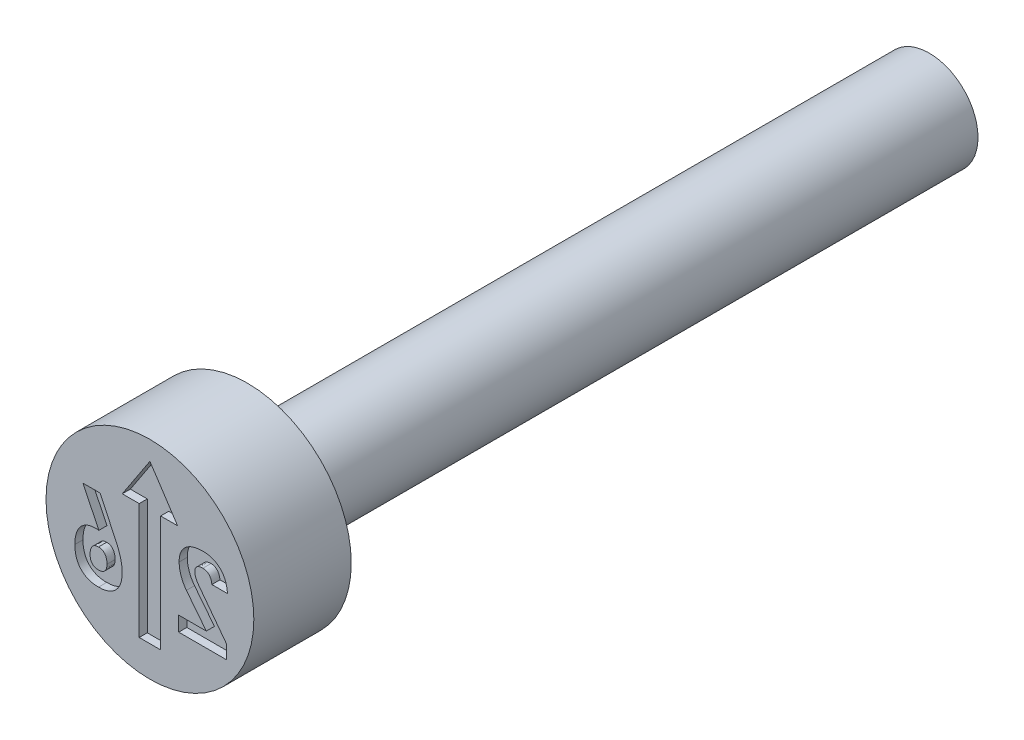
ISO-10303-21;
HEADER;
FILE_DESCRIPTION(('STEP AP214'),'2;1');
FILE_NAME('part.step','',(''),(''),'','','');
FILE_SCHEMA(('AUTOMOTIVE_DESIGN { 1 0 10303 214 1 1 1 1 }'));
ENDSEC;
DATA;
#1=APPLICATION_CONTEXT('core data for automotive mechanical design processes');
#2=APPLICATION_PROTOCOL_DEFINITION('international standard','automotive_design',2000,#1);
#3=PRODUCT_CONTEXT('',#1,'mechanical');
#4=PRODUCT('Part','Part','',(#3));
#5=PRODUCT_RELATED_PRODUCT_CATEGORY('part','',(#4));
#6=PRODUCT_DEFINITION_FORMATION('','',#4);
#7=PRODUCT_DEFINITION_CONTEXT('part definition',#1,'design');
#8=PRODUCT_DEFINITION('design','',#6,#7);
#9=PRODUCT_DEFINITION_SHAPE('','',#8);
#10=(LENGTH_UNIT() NAMED_UNIT(*) SI_UNIT(.MILLI.,.METRE.));
#11=(NAMED_UNIT(*) PLANE_ANGLE_UNIT() SI_UNIT($,.RADIAN.));
#12=(NAMED_UNIT(*) SI_UNIT($,.STERADIAN.) SOLID_ANGLE_UNIT());
#13=UNCERTAINTY_MEASURE_WITH_UNIT(LENGTH_MEASURE(1.E-05),#10,'distance_accuracy_value','');
#14=(GEOMETRIC_REPRESENTATION_CONTEXT(3) GLOBAL_UNCERTAINTY_ASSIGNED_CONTEXT((#13)) GLOBAL_UNIT_ASSIGNED_CONTEXT((#10,
#11,#12)) REPRESENTATION_CONTEXT('',''));
#15=CARTESIAN_POINT('',(0.,0.,0.));
#16=DIRECTION('',(0.,0.,1.));
#17=DIRECTION('',(1.,0.,0.));
#18=AXIS2_PLACEMENT_3D('',#15,#16,#17);
#19=CARTESIAN_POINT('',(-0.33,-2.25,-4.2002794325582));
#20=DIRECTION('',(-1.,0.,0.));
#21=DIRECTION('',(0.,0.,1.));
#22=AXIS2_PLACEMENT_3D('',#19,#20,#21);
#23=PLANE('',#22);
#24=DIRECTION('',(0.,-1.,0.));
#25=VECTOR('',#24,1.);
#26=CARTESIAN_POINT('',(-0.33,1.32083870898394,-0.24895886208));
#27=LINE('',#26,#25);
#28=CARTESIAN_POINT('',(-0.33,1.32083870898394,-0.24895886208));
#29=VERTEX_POINT('',#28);
#30=CARTESIAN_POINT('',(-0.33,-2.25,-0.24895886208));
#31=VERTEX_POINT('',#30);
#32=EDGE_CURVE('E51',#29,#31,#27,.T.);
#33=ORIENTED_EDGE('',*,*,#32,.F.);
#34=DIRECTION('',(0.,0.,1.));
#35=VECTOR('',#34,1.);
#36=CARTESIAN_POINT('',(-0.33,1.32083870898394,-0.28447943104));
#37=LINE('',#36,#35);
#38=CARTESIAN_POINT('',(-0.33,1.32083870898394,0.));
#39=VERTEX_POINT('',#38);
#40=EDGE_CURVE('E541',#39,#29,#37,.F.);
#41=ORIENTED_EDGE('',*,*,#40,.F.);
#42=DIRECTION('',(0.,1.,0.));
#43=VECTOR('',#42,1.);
#44=CARTESIAN_POINT('',(-0.33,0.,0.));
#45=LINE('',#44,#43);
#46=CARTESIAN_POINT('',(-0.33,-2.25,0.));
#47=VERTEX_POINT('',#46);
#48=EDGE_CURVE('E575',#47,#39,#45,.T.);
#49=ORIENTED_EDGE('',*,*,#48,.F.);
#50=DIRECTION('',(0.,0.,-1.));
#51=VECTOR('',#50,1.);
#52=CARTESIAN_POINT('',(-0.33,-2.25,-4.2002794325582));
#53=LINE('',#52,#51);
#54=EDGE_CURVE('E304',#47,#31,#53,.T.);
#55=ORIENTED_EDGE('',*,*,#54,.T.);
#56=EDGE_LOOP('',(#33,#41,#49,#55));
#57=FACE_BOUND('',#56,.T.);
#58=ADVANCED_FACE('F37',(#57),#23,.F.);
#59=CARTESIAN_POINT('',(5.684330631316E-13,1.32083870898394,-0.28447943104));
#60=DIRECTION('',(0.,1.,0.));
#61=DIRECTION('',(0.,0.,1.));
#62=AXIS2_PLACEMENT_3D('',#59,#60,#61);
#63=PLANE('',#62);
#64=ORIENTED_EDGE('',*,*,#40,.T.);
#65=DIRECTION('',(1.,0.,0.));
#66=VECTOR('',#65,1.);
#67=CARTESIAN_POINT('',(-0.851282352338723,1.32083870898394,-0.24895886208));
#68=LINE('',#67,#66);
#69=CARTESIAN_POINT('',(-0.851282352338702,1.32083870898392,-0.24895886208));
#70=VERTEX_POINT('',#69);
#71=EDGE_CURVE('E58',#70,#29,#68,.T.);
#72=ORIENTED_EDGE('',*,*,#71,.F.);
#73=DIRECTION('',(0.,0.,1.));
#74=VECTOR('',#73,1.);
#75=CARTESIAN_POINT('',(-0.851282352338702,1.32083870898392,-1.30047739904));
#76=LINE('',#75,#74);
#77=CARTESIAN_POINT('',(-0.851282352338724,1.32083870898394,0.));
#78=VERTEX_POINT('',#77);
#79=EDGE_CURVE('E545',#70,#78,#76,.T.);
#80=ORIENTED_EDGE('',*,*,#79,.T.);
#81=DIRECTION('',(1.,0.,0.));
#82=VECTOR('',#81,1.);
#83=CARTESIAN_POINT('',(1.59999680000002,1.32083870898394,0.));
#84=LINE('',#83,#82);
#85=EDGE_CURVE('E543',#39,#78,#84,.F.);
#86=ORIENTED_EDGE('',*,*,#85,.F.);
#87=EDGE_LOOP('',(#64,#72,#80,#86));
#88=FACE_BOUND('',#87,.T.);
#89=ADVANCED_FACE('F534',(#88),#63,.T.);
#90=CARTESIAN_POINT('',(-1.44383534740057,0.421431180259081,-1.30047739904));
#91=DIRECTION('',(-0.835059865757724,0.550159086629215,0.));
#92=DIRECTION('',(-0.550159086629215,-0.835059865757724,0.));
#93=AXIS2_PLACEMENT_3D('',#90,#91,#92);
#94=PLANE('',#93);
#95=DIRECTION('',(-0.550159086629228,-0.835059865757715,0.));
#96=VECTOR('',#95,1.);
#97=CARTESIAN_POINT('',(0.,2.61295901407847,-0.24895886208));
#98=LINE('',#97,#96);
#99=CARTESIAN_POINT('',(0.,2.61295901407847,-0.24895886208));
#100=VERTEX_POINT('',#99);
#101=EDGE_CURVE('E550',#100,#70,#98,.T.);
#102=ORIENTED_EDGE('',*,*,#101,.F.);
#103=DIRECTION('',(0.,0.,1.));
#104=VECTOR('',#103,1.);
#105=CARTESIAN_POINT('',(0.,2.61295901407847,-1.30047739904));
#106=LINE('',#105,#104);
#107=CARTESIAN_POINT('',(0.,2.61295901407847,0.));
#108=VERTEX_POINT('',#107);
#109=EDGE_CURVE('E563',#100,#108,#106,.T.);
#110=ORIENTED_EDGE('',*,*,#109,.T.);
#111=DIRECTION('',(0.550159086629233,0.835059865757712,0.));
#112=VECTOR('',#111,1.);
#113=CARTESIAN_POINT('',(-0.851282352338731,1.32083870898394,0.));
#114=LINE('',#113,#112);
#115=EDGE_CURVE('E570',#78,#108,#114,.T.);
#116=ORIENTED_EDGE('',*,*,#115,.F.);
#117=ORIENTED_EDGE('',*,*,#79,.F.);
#118=EDGE_LOOP('',(#102,#110,#116,#117));
#119=FACE_BOUND('',#118,.T.);
#120=ADVANCED_FACE('F531',(#119),#94,.F.);
#121=CARTESIAN_POINT('',(0.,2.61295901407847,-1.30047739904));
#122=DIRECTION('',(0.835059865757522,0.550159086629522,0.));
#123=DIRECTION('',(-0.550159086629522,0.835059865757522,0.));
#124=AXIS2_PLACEMENT_3D('',#121,#122,#123);
#125=PLANE('',#124);
#126=DIRECTION('',(-0.550159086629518,0.835059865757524,0.));
#127=VECTOR('',#126,1.);
#128=CARTESIAN_POINT('',(0.851282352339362,1.32083870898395,-0.24895886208));
#129=LINE('',#128,#127);
#130=CARTESIAN_POINT('',(0.851282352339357,1.32083870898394,-0.24895886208));
#131=VERTEX_POINT('',#130);
#132=EDGE_CURVE('E551',#131,#100,#129,.T.);
#133=ORIENTED_EDGE('',*,*,#132,.F.);
#134=DIRECTION('',(0.,0.,1.));
#135=VECTOR('',#134,1.);
#136=CARTESIAN_POINT('',(0.851282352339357,1.32083870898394,-0.28447943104));
#137=LINE('',#136,#135);
#138=CARTESIAN_POINT('',(0.851282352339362,1.32083870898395,0.));
#139=VERTEX_POINT('',#138);
#140=EDGE_CURVE('E558',#139,#131,#137,.F.);
#141=ORIENTED_EDGE('',*,*,#140,.F.);
#142=DIRECTION('',(0.550159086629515,-0.835059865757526,0.));
#143=VECTOR('',#142,1.);
#144=CARTESIAN_POINT('',(0.,2.61295901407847,0.));
#145=LINE('',#144,#143);
#146=EDGE_CURVE('E573',#108,#139,#145,.T.);
#147=ORIENTED_EDGE('',*,*,#146,.F.);
#148=ORIENTED_EDGE('',*,*,#109,.F.);
#149=EDGE_LOOP('',(#133,#141,#147,#148));
#150=FACE_BOUND('',#149,.T.);
#151=ADVANCED_FACE('F527',(#150),#125,.F.);
#152=CARTESIAN_POINT('',(5.684330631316E-13,1.32083870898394,-0.28447943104));
#153=DIRECTION('',(0.,1.,0.));
#154=DIRECTION('',(0.,0.,1.));
#155=AXIS2_PLACEMENT_3D('',#152,#153,#154);
#156=PLANE('',#155);
#157=ORIENTED_EDGE('',*,*,#140,.T.);
#158=DIRECTION('',(1.,0.,0.));
#159=VECTOR('',#158,1.);
#160=CARTESIAN_POINT('',(0.33,1.32083870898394,-0.24895886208));
#161=LINE('',#160,#159);
#162=CARTESIAN_POINT('',(0.33,1.32083870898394,-0.24895886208));
#163=VERTEX_POINT('',#162);
#164=EDGE_CURVE('E555',#163,#131,#161,.T.);
#165=ORIENTED_EDGE('',*,*,#164,.F.);
#166=DIRECTION('',(0.,0.,-1.));
#167=VECTOR('',#166,1.);
#168=CARTESIAN_POINT('',(0.33,1.32083870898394,-4.2002794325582));
#169=LINE('',#168,#167);
#170=CARTESIAN_POINT('',(0.33,1.32083870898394,0.));
#171=VERTEX_POINT('',#170);
#172=EDGE_CURVE('E305',#163,#171,#169,.F.);
#173=ORIENTED_EDGE('',*,*,#172,.T.);
#174=DIRECTION('',(1.,0.,0.));
#175=VECTOR('',#174,1.);
#176=CARTESIAN_POINT('',(1.59999680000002,1.32083870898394,0.));
#177=LINE('',#176,#175);
#178=EDGE_CURVE('E560',#139,#171,#177,.F.);
#179=ORIENTED_EDGE('',*,*,#178,.F.);
#180=EDGE_LOOP('',(#157,#165,#173,#179));
#181=FACE_BOUND('',#180,.T.);
#182=ADVANCED_FACE('F524',(#181),#156,.T.);
#183=CARTESIAN_POINT('',(0.33,-2.25,-4.2002794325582));
#184=DIRECTION('',(1.,0.,0.));
#185=DIRECTION('',(0.,0.,-1.));
#186=AXIS2_PLACEMENT_3D('',#183,#184,#185);
#187=PLANE('',#186);
#188=DIRECTION('',(0.,1.,0.));
#189=VECTOR('',#188,1.);
#190=CARTESIAN_POINT('',(0.33,-2.25,-0.24895886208));
#191=LINE('',#190,#189);
#192=CARTESIAN_POINT('',(0.33,-2.25,-0.24895886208));
#193=VERTEX_POINT('',#192);
#194=EDGE_CURVE('E309',#193,#163,#191,.T.);
#195=ORIENTED_EDGE('',*,*,#194,.F.);
#196=DIRECTION('',(0.,0.,-1.));
#197=VECTOR('',#196,1.);
#198=CARTESIAN_POINT('',(0.33,-2.25,-4.2002794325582));
#199=LINE('',#198,#197);
#200=CARTESIAN_POINT('',(0.33,-2.25,0.));
#201=VERTEX_POINT('',#200);
#202=EDGE_CURVE('E293',#193,#201,#199,.F.);
#203=ORIENTED_EDGE('',*,*,#202,.T.);
#204=DIRECTION('',(0.,1.,0.));
#205=VECTOR('',#204,1.);
#206=CARTESIAN_POINT('',(0.33,0.,0.));
#207=LINE('',#206,#205);
#208=EDGE_CURVE('E580',#171,#201,#207,.F.);
#209=ORIENTED_EDGE('',*,*,#208,.F.);
#210=ORIENTED_EDGE('',*,*,#172,.F.);
#211=EDGE_LOOP('',(#195,#203,#209,#210));
#212=FACE_BOUND('',#211,.T.);
#213=ADVANCED_FACE('F310',(#212),#187,.F.);
#214=CARTESIAN_POINT('',(-0.33,-2.25,-4.2002794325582));
#215=DIRECTION('',(0.,-1.,0.));
#216=DIRECTION('',(0.,0.,-1.));
#217=AXIS2_PLACEMENT_3D('',#214,#215,#216);
#218=PLANE('',#217);
#219=DIRECTION('',(1.,0.,0.));
#220=VECTOR('',#219,1.);
#221=CARTESIAN_POINT('',(-0.33,-2.25,-0.24895886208));
#222=LINE('',#221,#220);
#223=EDGE_CURVE('E298',#31,#193,#222,.T.);
#224=ORIENTED_EDGE('',*,*,#223,.F.);
#225=ORIENTED_EDGE('',*,*,#54,.F.);
#226=DIRECTION('',(1.,0.,0.));
#227=VECTOR('',#226,1.);
#228=CARTESIAN_POINT('',(1.59999680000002,-2.25,0.));
#229=LINE('',#228,#227);
#230=EDGE_CURVE('E300',#201,#47,#229,.F.);
#231=ORIENTED_EDGE('',*,*,#230,.F.);
#232=ORIENTED_EDGE('',*,*,#202,.F.);
#233=EDGE_LOOP('',(#224,#225,#231,#232));
#234=FACE_BOUND('',#233,.T.);
#235=ADVANCED_FACE('F295',(#234),#218,.F.);
#236=CARTESIAN_POINT('',(1.59999680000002,0.,0.));
#237=DIRECTION('',(0.,0.,1.));
#238=DIRECTION('',(1.,0.,0.));
#239=AXIS2_PLACEMENT_3D('',#236,#237,#238);
#240=PLANE('',#239);
#241=CARTESIAN_POINT('',(-2.31110766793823,-0.761870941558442,0.));
#242=CARTESIAN_POINT('',(-2.31056204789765,-0.791490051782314,0.));
#243=CARTESIAN_POINT('',(-2.30949614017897,-0.849353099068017,0.));
#244=CARTESIAN_POINT('',(-2.30009397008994,-0.933449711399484,0.));
#245=CARTESIAN_POINT('',(-2.28568784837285,-1.01260801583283,0.));
#246=CARTESIAN_POINT('',(-2.26488956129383,-1.08653722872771,0.));
#247=CARTESIAN_POINT('',(-2.23798597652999,-1.1554210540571,0.));
#248=CARTESIAN_POINT('',(-2.20493533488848,-1.21928274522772,0.));
#249=CARTESIAN_POINT('',(-2.16558557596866,-1.27780711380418,0.));
#250=CARTESIAN_POINT('',(-2.1210558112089,-1.33141848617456,0.));
#251=CARTESIAN_POINT('',(-2.07051752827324,-1.37859421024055,0.));
#252=CARTESIAN_POINT('',(-2.01532620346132,-1.42004626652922,0.));
#253=CARTESIAN_POINT('',(-1.95528761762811,-1.45546289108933,0.));
#254=CARTESIAN_POINT('',(-1.88951289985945,-1.48301427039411,0.));
#255=CARTESIAN_POINT('',(-1.81950678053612,-1.50563072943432,0.));
#256=CARTESIAN_POINT('',(-1.7443056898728,-1.52099335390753,0.));
#257=CARTESIAN_POINT('',(-1.66456396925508,-1.53098107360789,0.));
#258=CARTESIAN_POINT('',(-1.60970558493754,-1.53196400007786,0.));
#259=CARTESIAN_POINT('',(-1.58160279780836,-1.53246753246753,0.));
#260=B_SPLINE_CURVE_WITH_KNOTS('',3,(#241,#242,#243,#244,#245,#246,#247,#248,#249,#250,#251,
#252,#253,#254,#255,#256,#257,#258,#259),.UNSPECIFIED.,.F.,.F.,(4,1,1,1,1,1,1,1,1,1,1,1,1,1,1,1,
4),(0.,0.0736363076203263,0.143853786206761,0.210167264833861,0.273535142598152,
0.334525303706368,0.393774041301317,0.451974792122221,0.509587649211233,0.566708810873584,
0.623480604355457,0.680964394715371,0.739551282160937,0.800463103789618,0.863640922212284,
0.930146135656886,1.),.UNSPECIFIED.);
#261=CARTESIAN_POINT('',(-2.31110766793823,-0.761870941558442,0.));
#262=VERTEX_POINT('',#261);
#263=CARTESIAN_POINT('',(-1.58160279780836,-1.53246753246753,0.));
#264=VERTEX_POINT('',#263);
#265=EDGE_CURVE('E379',#262,#264,#260,.T.);
#266=ORIENTED_EDGE('',*,*,#265,.F.);
#267=DIRECTION('',(0.,-1.,0.));
#268=VECTOR('',#267,1.);
#269=CARTESIAN_POINT('',(-2.31110766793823,-0.759841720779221,0.));
#270=LINE('',#269,#268);
#271=CARTESIAN_POINT('',(-2.31110766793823,-0.759841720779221,0.));
#272=VERTEX_POINT('',#271);
#273=EDGE_CURVE('E428',#272,#262,#270,.T.);
#274=ORIENTED_EDGE('',*,*,#273,.F.);
#275=CARTESIAN_POINT('',(-1.66226432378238,-0.00649350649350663,0.));
#276=CARTESIAN_POINT('',(-1.68731631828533,-0.00706155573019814,0.));
#277=CARTESIAN_POINT('',(-1.73607386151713,-0.00816712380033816,0.));
#278=CARTESIAN_POINT('',(-1.80702019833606,-0.0172123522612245,0.));
#279=CARTESIAN_POINT('',(-1.87332488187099,-0.0332414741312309,0.));
#280=CARTESIAN_POINT('',(-1.93582258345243,-0.054283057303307,0.));
#281=CARTESIAN_POINT('',(-1.99385714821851,-0.0823418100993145,0.));
#282=CARTESIAN_POINT('',(-2.04757250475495,-0.116674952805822,0.));
#283=CARTESIAN_POINT('',(-2.0970938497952,-0.156871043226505,0.));
#284=CARTESIAN_POINT('',(-2.14176851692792,-0.203412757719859,0.));
#285=CARTESIAN_POINT('',(-2.1820154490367,-0.255113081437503,0.));
#286=CARTESIAN_POINT('',(-2.21650542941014,-0.31249405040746,0.));
#287=CARTESIAN_POINT('',(-2.24614512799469,-0.374597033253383,0.));
#288=CARTESIAN_POINT('',(-2.26975824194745,-0.442043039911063,0.));
#289=CARTESIAN_POINT('',(-2.28868309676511,-0.514284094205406,0.));
#290=CARTESIAN_POINT('',(-2.30146156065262,-0.591730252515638,0.));
#291=CARTESIAN_POINT('',(-2.3099124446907,-0.674088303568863,0.));
#292=CARTESIAN_POINT('',(-2.31070196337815,-0.73073372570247,0.));
#293=CARTESIAN_POINT('',(-2.31110766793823,-0.759841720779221,0.));
#294=B_SPLINE_CURVE_WITH_KNOTS('',3,(#275,#276,#277,#278,#279,#280,#281,#282,#283,#284,#285,
#286,#287,#288,#289,#290,#291,#292,#293),.UNSPECIFIED.,.F.,.F.,(4,1,1,1,1,1,1,1,1,1,1,1,1,1,1,1,
4),(0.,0.0665766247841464,0.12957501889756,0.189644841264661,0.24763903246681,0.304530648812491,
0.360514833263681,0.416743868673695,0.473642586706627,0.531631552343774,0.590524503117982,
0.65124161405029,0.714220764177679,0.780176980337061,0.849489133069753,0.922658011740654,1.),.UNSPECIFIED.);
#295=CARTESIAN_POINT('',(-1.66226432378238,-0.00649350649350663,0.));
#296=VERTEX_POINT('',#295);
#297=EDGE_CURVE('E420',#296,#272,#294,.T.);
#298=ORIENTED_EDGE('',*,*,#297,.F.);
#299=CARTESIAN_POINT('',(-1.34519857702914,-0.176948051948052,0.));
#300=CARTESIAN_POINT('',(-1.35288383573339,-0.163296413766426,0.));
#301=CARTESIAN_POINT('',(-1.36794597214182,-0.136540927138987,0.));
#302=CARTESIAN_POINT('',(-1.39761607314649,-0.101913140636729,0.));
#303=CARTESIAN_POINT('',(-1.4307068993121,-0.0718420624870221,0.));
#304=CARTESIAN_POINT('',(-1.46897693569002,-0.0479243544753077,0.));
#305=CARTESIAN_POINT('',(-1.51129161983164,-0.0290017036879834,0.));
#306=CARTESIAN_POINT('',(-1.55799704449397,-0.0161013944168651,0.));
#307=CARTESIAN_POINT('',(-1.60868953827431,-0.00763809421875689,0.));
#308=CARTESIAN_POINT('',(-1.64396422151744,-0.00688447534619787,0.));
#309=CARTESIAN_POINT('',(-1.66226432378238,-0.00649350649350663,0.));
#310=B_SPLINE_CURVE_WITH_KNOTS('',3,(#299,#300,#301,#302,#303,#304,#305,#306,#307,#308,#309),
.UNSPECIFIED.,.F.,.F.,(4,1,1,1,1,1,1,1,4),(0.,0.123274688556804,0.241602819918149,
0.357777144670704,0.474683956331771,0.595870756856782,0.722082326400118,0.85581948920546,1.),.UNSPECIFIED.);
#311=CARTESIAN_POINT('',(-1.57208936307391,-0.0140994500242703,0.));
#312=VERTEX_POINT('',#311);
#313=EDGE_CURVE('E415',#312,#296,#310,.T.);
#314=ORIENTED_EDGE('',*,*,#313,.F.);
#315=DIRECTION('',(0.435377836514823,-0.900247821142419,0.));
#316=VECTOR('',#315,1.);
#317=CARTESIAN_POINT('',(-2.06252812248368,1.,0.));
#318=LINE('',#317,#316);
#319=CARTESIAN_POINT('',(-2.06252812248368,1.,0.));
#320=VERTEX_POINT('',#319);
#321=EDGE_CURVE('E412',#320,#312,#318,.T.);
#322=ORIENTED_EDGE('',*,*,#321,.F.);
#323=DIRECTION('',(-1.,0.,0.));
#324=VECTOR('',#323,1.);
#325=CARTESIAN_POINT('',(-1.53188688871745,1.,0.));
#326=LINE('',#325,#324);
#327=CARTESIAN_POINT('',(-1.53188688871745,1.,0.));
#328=VERTEX_POINT('',#327);
#329=EDGE_CURVE('E409',#328,#320,#326,.T.);
#330=ORIENTED_EDGE('',*,*,#329,.F.);
#331=DIRECTION('',(-0.424073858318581,0.905627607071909,0.));
#332=VECTOR('',#331,1.);
#333=CARTESIAN_POINT('',(-1.02661091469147,-0.0790381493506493,0.));
#334=LINE('',#333,#332);
#335=CARTESIAN_POINT('',(-1.02661091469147,-0.0790381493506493,0.));
#336=VERTEX_POINT('',#335);
#337=EDGE_CURVE('E403',#336,#328,#334,.T.);
#338=ORIENTED_EDGE('',*,*,#337,.F.);
#339=CARTESIAN_POINT('',(-0.854127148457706,-0.774046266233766,0.));
#340=CARTESIAN_POINT('',(-0.854767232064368,-0.746630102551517,0.));
#341=CARTESIAN_POINT('',(-0.856070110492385,-0.690825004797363,0.));
#342=CARTESIAN_POINT('',(-0.865156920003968,-0.606126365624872,0.));
#343=CARTESIAN_POINT('',(-0.879197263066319,-0.519162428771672,0.));
#344=CARTESIAN_POINT('',(-0.89979184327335,-0.430711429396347,0.));
#345=CARTESIAN_POINT('',(-0.924903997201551,-0.341678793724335,0.));
#346=CARTESIAN_POINT('',(-0.954652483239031,-0.253089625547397,0.));
#347=CARTESIAN_POINT('',(-0.98773130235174,-0.165152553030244,0.));
#348=CARTESIAN_POINT('',(-1.01361479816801,-0.107823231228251,0.));
#349=CARTESIAN_POINT('',(-1.02661091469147,-0.0790381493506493,0.));
#350=B_SPLINE_CURVE_WITH_KNOTS('',3,(#339,#340,#341,#342,#343,#344,#345,#346,#347,#348,#349),
.UNSPECIFIED.,.F.,.F.,(4,1,1,1,1,1,1,1,4),(0.,0.114002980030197,0.232050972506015,
0.353906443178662,0.480147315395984,0.609491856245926,0.738474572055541,0.868687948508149,1.),.UNSPECIFIED.);
#351=CARTESIAN_POINT('',(-0.854127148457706,-0.774046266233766,0.));
#352=VERTEX_POINT('',#351);
#353=EDGE_CURVE('E398',#352,#336,#350,.T.);
#354=ORIENTED_EDGE('',*,*,#353,.F.);
#355=DIRECTION('',(0.,1.,0.));
#356=VECTOR('',#355,1.);
#357=CARTESIAN_POINT('',(-0.854127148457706,-0.775568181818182,0.));
#358=LINE('',#357,#356);
#359=CARTESIAN_POINT('',(-0.854127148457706,-0.775568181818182,0.));
#360=VERTEX_POINT('',#359);
#361=EDGE_CURVE('E392',#360,#352,#358,.T.);
#362=ORIENTED_EDGE('',*,*,#361,.F.);
#363=CARTESIAN_POINT('',(-1.58160279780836,-1.53246753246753,0.));
#364=CARTESIAN_POINT('',(-1.55350833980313,-1.53190400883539,0.));
#365=CARTESIAN_POINT('',(-1.49885403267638,-1.53080774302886,0.));
#366=CARTESIAN_POINT('',(-1.41934698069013,-1.52171823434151,0.));
#367=CARTESIAN_POINT('',(-1.34482009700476,-1.5059302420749,0.));
#368=CARTESIAN_POINT('',(-1.27494617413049,-1.48414180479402,0.));
#369=CARTESIAN_POINT('',(-1.20972274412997,-1.45628974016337,0.));
#370=CARTESIAN_POINT('',(-1.14943883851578,-1.42214340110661,0.));
#371=CARTESIAN_POINT('',(-1.09406466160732,-1.38167872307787,0.));
#372=CARTESIAN_POINT('',(-1.04388028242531,-1.33498311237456,0.));
#373=CARTESIAN_POINT('',(-0.999238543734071,-1.2826390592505,0.));
#374=CARTESIAN_POINT('',(-0.960245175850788,-1.22515787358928,0.));
#375=CARTESIAN_POINT('',(-0.927229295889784,-1.1625581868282,0.));
#376=CARTESIAN_POINT('',(-0.900451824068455,-1.09480805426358,0.));
#377=CARTESIAN_POINT('',(-0.879449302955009,-1.02211608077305,0.));
#378=CARTESIAN_POINT('',(-0.865244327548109,-0.944432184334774,0.));
#379=CARTESIAN_POINT('',(-0.855677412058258,-0.861708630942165,0.));
#380=CARTESIAN_POINT('',(-0.854654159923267,-0.804851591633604,0.));
#381=CARTESIAN_POINT('',(-0.854127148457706,-0.775568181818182,0.));
#382=B_SPLINE_CURVE_WITH_KNOTS('',3,(#363,#364,#365,#366,#367,#368,#369,#370,#371,#372,#373,
#374,#375,#376,#377,#378,#379,#380,#381),.UNSPECIFIED.,.F.,.F.,(4,1,1,1,1,1,1,1,1,1,1,1,1,1,1,1,
4),(0.,0.0706034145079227,0.137350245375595,0.20079014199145,0.261822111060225,
0.321037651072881,0.37871381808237,0.435588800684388,0.493032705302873,0.550614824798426,
0.608145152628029,0.667276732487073,0.728130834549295,0.790952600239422,0.85714223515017,
0.926423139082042,1.),.UNSPECIFIED.);
#383=EDGE_CURVE('E383',#264,#360,#382,.T.);
#384=ORIENTED_EDGE('',*,*,#383,.F.);
#385=EDGE_LOOP('',(#266,#274,#298,#314,#322,#330,#338,#354,#362,#384));
#386=FACE_BOUND('',#385,.T.);
#387=DIRECTION('',(1.,0.,0.));
#388=VECTOR('',#387,1.);
#389=CARTESIAN_POINT('',(0.885949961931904,-1.5,0.));
#390=LINE('',#389,#388);
#391=CARTESIAN_POINT('',(0.885949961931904,-1.5,0.));
#392=VERTEX_POINT('',#391);
#393=CARTESIAN_POINT('',(2.35814963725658,-1.5,0.));
#394=VERTEX_POINT('',#393);
#395=EDGE_CURVE('E437',#392,#394,#390,.T.);
#396=ORIENTED_EDGE('',*,*,#395,.F.);
#397=DIRECTION('',(0.,-1.,0.));
#398=VECTOR('',#397,1.);
#399=CARTESIAN_POINT('',(0.885949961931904,-1.04545454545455,0.));
#400=LINE('',#399,#398);
#401=CARTESIAN_POINT('',(0.885949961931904,-1.04545454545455,0.));
#402=VERTEX_POINT('',#401);
#403=EDGE_CURVE('E460',#402,#392,#400,.T.);
#404=ORIENTED_EDGE('',*,*,#403,.F.);
#405=DIRECTION('',(-1.,0.,0.));
#406=VECTOR('',#405,1.);
#407=CARTESIAN_POINT('',(1.73670077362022,-1.04545454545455,0.));
#408=LINE('',#407,#406);
#409=CARTESIAN_POINT('',(1.73670077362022,-1.04545454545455,0.));
#410=VERTEX_POINT('',#409);
#411=EDGE_CURVE('E629',#410,#402,#408,.T.);
#412=ORIENTED_EDGE('',*,*,#411,.F.);
#413=DIRECTION('',(0.618183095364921,-0.786034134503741,0.));
#414=VECTOR('',#413,1.);
#415=CARTESIAN_POINT('',(1.12387609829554,-0.266233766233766,0.));
#416=LINE('',#415,#414);
#417=CARTESIAN_POINT('',(1.12387609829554,-0.266233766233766,0.));
#418=VERTEX_POINT('',#417);
#419=EDGE_CURVE('E632',#418,#410,#416,.T.);
#420=ORIENTED_EDGE('',*,*,#419,.F.);
#421=CARTESIAN_POINT('',(0.899647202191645,0.377029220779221,0.));
#422=CARTESIAN_POINT('',(0.900293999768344,0.3485838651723,0.));
#423=CARTESIAN_POINT('',(0.901588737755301,0.29164289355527,0.));
#424=CARTESIAN_POINT('',(0.913275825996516,0.206422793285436,0.));
#425=CARTESIAN_POINT('',(0.932109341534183,0.121637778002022,0.));
#426=CARTESIAN_POINT('',(0.957974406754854,0.0376974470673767,0.));
#427=CARTESIAN_POINT('',(0.990105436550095,-0.0439442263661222,0.));
#428=CARTESIAN_POINT('',(1.02866885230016,-0.122169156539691,0.));
#429=CARTESIAN_POINT('',(1.0721926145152,-0.197011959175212,0.));
#430=CARTESIAN_POINT('',(1.10668125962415,-0.243204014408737,0.));
#431=CARTESIAN_POINT('',(1.12387609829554,-0.266233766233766,0.));
#432=B_SPLINE_CURVE_WITH_KNOTS('',3,(#421,#422,#423,#424,#425,#426,#427,#428,#429,#430,#431),
.UNSPECIFIED.,.F.,.F.,(4,1,1,1,1,1,1,1,4),(0.,0.123046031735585,0.246309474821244,
0.371480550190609,0.498560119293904,0.626024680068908,0.750715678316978,0.875715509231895,1.),.UNSPECIFIED.);
#433=CARTESIAN_POINT('',(0.899647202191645,0.377029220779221,0.));
#434=VERTEX_POINT('',#433);
#435=EDGE_CURVE('E635',#434,#418,#432,.T.);
#436=ORIENTED_EDGE('',*,*,#435,.F.);
#437=DIRECTION('',(0.,-1.,0.));
#438=VECTOR('',#437,1.);
#439=CARTESIAN_POINT('',(0.899647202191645,0.379058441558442,0.));
#440=LINE('',#439,#438);
#441=CARTESIAN_POINT('',(0.899647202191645,0.379058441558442,0.));
#442=VERTEX_POINT('',#441);
#443=EDGE_CURVE('E640',#442,#434,#440,.T.);
#444=ORIENTED_EDGE('',*,*,#443,.F.);
#445=CARTESIAN_POINT('',(1.63574703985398,1.03246753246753,0.));
#446=CARTESIAN_POINT('',(1.60731502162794,1.0320636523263,0.));
#447=CARTESIAN_POINT('',(1.55201850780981,1.03127815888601,0.));
#448=CARTESIAN_POINT('',(1.47151635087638,1.02279900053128,0.));
#449=CARTESIAN_POINT('',(1.39577235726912,1.01000147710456,0.));
#450=CARTESIAN_POINT('',(1.32490841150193,0.991279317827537,0.));
#451=CARTESIAN_POINT('',(1.25920900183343,0.966857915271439,0.));
#452=CARTESIAN_POINT('',(1.19847731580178,0.937411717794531,0.));
#453=CARTESIAN_POINT('',(1.14258640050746,0.902689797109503,0.));
#454=CARTESIAN_POINT('',(1.09196429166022,0.862617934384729,0.));
#455=CARTESIAN_POINT('',(1.04641690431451,0.817924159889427,0.));
#456=CARTESIAN_POINT('',(1.00721289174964,0.768154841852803,0.));
#457=CARTESIAN_POINT('',(0.973275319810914,0.714316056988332,0.));
#458=CARTESIAN_POINT('',(0.946746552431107,0.655363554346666,0.));
#459=CARTESIAN_POINT('',(0.924905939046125,0.592683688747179,0.));
#460=CARTESIAN_POINT('',(0.910764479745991,0.525152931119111,0.));
#461=CARTESIAN_POINT('',(0.90123493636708,0.453566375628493,0.));
#462=CARTESIAN_POINT('',(0.900184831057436,0.404287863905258,0.));
#463=CARTESIAN_POINT('',(0.899647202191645,0.379058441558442,0.));
#464=B_SPLINE_CURVE_WITH_KNOTS('',3,(#445,#446,#447,#448,#449,#450,#451,#452,#453,#454,#455,
#456,#457,#458,#459,#460,#461,#462,#463),.UNSPECIFIED.,.F.,.F.,(4,1,1,1,1,1,1,1,1,1,1,1,1,1,1,1,
4),(0.,0.0762312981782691,0.148259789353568,0.216860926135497,0.28210063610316,
0.344528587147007,0.404571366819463,0.462840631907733,0.520642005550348,0.577409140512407,
0.633580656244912,0.690215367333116,0.747647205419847,0.806597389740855,0.867894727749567,
0.932365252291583,1.),.UNSPECIFIED.);
#465=CARTESIAN_POINT('',(1.63574703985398,1.03246753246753,0.));
#466=VERTEX_POINT('',#465);
#467=EDGE_CURVE('E646',#466,#442,#464,.T.);
#468=ORIENTED_EDGE('',*,*,#467,.F.);
#469=CARTESIAN_POINT('',(2.3890952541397,0.282163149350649,0.));
#470=CARTESIAN_POINT('',(2.38672218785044,0.311141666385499,0.));
#471=CARTESIAN_POINT('',(2.38209001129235,0.367707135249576,0.));
#472=CARTESIAN_POINT('',(2.36690372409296,0.449531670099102,0.));
#473=CARTESIAN_POINT('',(2.34727604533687,0.526604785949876,0.));
#474=CARTESIAN_POINT('',(2.32230699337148,0.598911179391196,0.));
#475=CARTESIAN_POINT('',(2.29022167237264,0.665613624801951,0.));
#476=CARTESIAN_POINT('',(2.25417283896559,0.7281065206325,0.));
#477=CARTESIAN_POINT('',(2.21081512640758,0.784456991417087,0.));
#478=CARTESIAN_POINT('',(2.16335403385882,0.836550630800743,0.));
#479=CARTESIAN_POINT('',(2.11049086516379,0.88243395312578,0.));
#480=CARTESIAN_POINT('',(2.05412420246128,0.922909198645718,0.));
#481=CARTESIAN_POINT('',(1.99340169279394,0.956591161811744,0.));
#482=CARTESIAN_POINT('',(1.92924648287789,0.984532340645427,0.));
#483=CARTESIAN_POINT('',(1.86094727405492,1.00573890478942,0.));
#484=CARTESIAN_POINT('',(1.78939621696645,1.02162423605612,0.));
#485=CARTESIAN_POINT('',(1.71377203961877,1.0307853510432,0.));
#486=CARTESIAN_POINT('',(1.66215141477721,1.03189826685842,0.));
#487=CARTESIAN_POINT('',(1.63574703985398,1.03246753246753,0.));
#488=B_SPLINE_CURVE_WITH_KNOTS('',3,(#469,#470,#471,#472,#473,#474,#475,#476,#477,#478,#479,
#480,#481,#482,#483,#484,#485,#486,#487),.UNSPECIFIED.,.F.,.F.,(4,1,1,1,1,1,1,1,1,1,1,1,1,1,1,1,
4),(0.,0.073326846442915,0.14313249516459,0.209679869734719,0.273918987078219,0.33576228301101,
0.396210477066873,0.45560885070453,0.514796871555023,0.573764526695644,0.631900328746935,
0.689592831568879,0.748648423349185,0.808163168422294,0.86976604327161,0.933384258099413,1.),.UNSPECIFIED.);
#489=CARTESIAN_POINT('',(2.3890952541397,0.282163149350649,0.));
#490=VERTEX_POINT('',#489);
#491=EDGE_CURVE('E651',#490,#466,#488,.T.);
#492=ORIENTED_EDGE('',*,*,#491,.F.);
#493=DIRECTION('',(0.,1.,0.));
#494=VECTOR('',#493,1.);
#495=CARTESIAN_POINT('',(2.3890952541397,0.280641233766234,0.));
#496=LINE('',#495,#494);
#497=CARTESIAN_POINT('',(2.3890952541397,0.280641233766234,0.));
#498=VERTEX_POINT('',#497);
#499=EDGE_CURVE('E659',#498,#490,#496,.T.);
#500=ORIENTED_EDGE('',*,*,#499,.F.);
#501=DIRECTION('',(1.,0.,0.));
#502=VECTOR('',#501,1.);
#503=CARTESIAN_POINT('',(1.90816992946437,0.280641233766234,0.));
#504=LINE('',#503,#502);
#505=CARTESIAN_POINT('',(1.90816992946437,0.280641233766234,0.));
#506=VERTEX_POINT('',#505);
#507=EDGE_CURVE('E665',#506,#498,#504,.T.);
#508=ORIENTED_EDGE('',*,*,#507,.F.);
#509=DIRECTION('',(0.,-1.,0.));
#510=VECTOR('',#509,1.);
#511=CARTESIAN_POINT('',(1.90816992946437,0.282163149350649,0.));
#512=LINE('',#511,#510);
#513=CARTESIAN_POINT('',(1.90816992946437,0.282163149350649,0.));
#514=VERTEX_POINT('',#513);
#515=EDGE_CURVE('E668',#514,#506,#512,.T.);
#516=ORIENTED_EDGE('',*,*,#515,.F.);
#517=CARTESIAN_POINT('',(1.63219590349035,0.577922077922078,0.));
#518=CARTESIAN_POINT('',(1.65057456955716,0.577204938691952,0.));
#519=CARTESIAN_POINT('',(1.68628495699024,0.57581151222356,0.));
#520=CARTESIAN_POINT('',(1.73683909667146,0.56036841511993,0.));
#521=CARTESIAN_POINT('',(1.78239330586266,0.536144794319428,0.));
#522=CARTESIAN_POINT('',(1.82166465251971,0.501580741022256,0.));
#523=CARTESIAN_POINT('',(1.85418430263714,0.458184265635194,0.));
#524=CARTESIAN_POINT('',(1.88057714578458,0.407081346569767,0.));
#525=CARTESIAN_POINT('',(1.89850296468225,0.347349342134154,0.));
#526=CARTESIAN_POINT('',(1.90484392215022,0.304591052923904,0.));
#527=CARTESIAN_POINT('',(1.90816992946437,0.282163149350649,0.));
#528=B_SPLINE_CURVE_WITH_KNOTS('',3,(#517,#518,#519,#520,#521,#522,#523,#524,#525,#526,#527),
.UNSPECIFIED.,.F.,.F.,(4,1,1,1,1,1,1,1,4),(0.,0.122603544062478,0.238222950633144,
0.350089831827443,0.465559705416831,0.58502806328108,0.711014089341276,0.848418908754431,1.),.UNSPECIFIED.);
#529=CARTESIAN_POINT('',(1.63219590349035,0.577922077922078,0.));
#530=VERTEX_POINT('',#529);
#531=EDGE_CURVE('E671',#530,#514,#528,.T.);
#532=ORIENTED_EDGE('',*,*,#531,.F.);
#533=CARTESIAN_POINT('',(1.38260174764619,0.365868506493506,0.));
#534=CARTESIAN_POINT('',(1.38329475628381,0.381853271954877,0.));
#535=CARTESIAN_POINT('',(1.38462245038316,0.41247753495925,0.));
#536=CARTESIAN_POINT('',(1.39713141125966,0.455627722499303,0.));
#537=CARTESIAN_POINT('',(1.41763292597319,0.493204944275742,0.));
#538=CARTESIAN_POINT('',(1.44699604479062,0.524243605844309,0.));
#539=CARTESIAN_POINT('',(1.48355088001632,0.54879331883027,0.));
#540=CARTESIAN_POINT('',(1.52728975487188,0.566094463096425,0.));
#541=CARTESIAN_POINT('',(1.57764038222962,0.576015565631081,0.));
#542=CARTESIAN_POINT('',(1.61337907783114,0.577264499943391,0.));
#543=CARTESIAN_POINT('',(1.63219590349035,0.577922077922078,0.));
#544=B_SPLINE_CURVE_WITH_KNOTS('',3,(#533,#534,#535,#536,#537,#538,#539,#540,#541,#542,#543),
.UNSPECIFIED.,.F.,.F.,(4,1,1,1,1,1,1,1,4),(0.,0.128749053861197,0.246662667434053,
0.359069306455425,0.47107757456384,0.588039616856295,0.711712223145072,0.848213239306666,1.),.UNSPECIFIED.);
#545=CARTESIAN_POINT('',(1.38260174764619,0.365868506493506,0.));
#546=VERTEX_POINT('',#545);
#547=EDGE_CURVE('E676',#546,#530,#544,.T.);
#548=ORIENTED_EDGE('',*,*,#547,.F.);
#549=DIRECTION('',(0.,1.,0.));
#550=VECTOR('',#549,1.);
#551=CARTESIAN_POINT('',(1.38260174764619,0.36231737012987,0.));
#552=LINE('',#551,#550);
#553=CARTESIAN_POINT('',(1.38260174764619,0.36231737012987,0.));
#554=VERTEX_POINT('',#553);
#555=EDGE_CURVE('E684',#554,#546,#552,.T.);
#556=ORIENTED_EDGE('',*,*,#555,.F.);
#557=CARTESIAN_POINT('',(1.50384768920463,0.0569196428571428,0.));
#558=CARTESIAN_POINT('',(1.48595418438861,0.0821325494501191,0.));
#559=CARTESIAN_POINT('',(1.45108923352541,0.131259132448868,0.));
#560=CARTESIAN_POINT('',(1.41953376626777,0.198724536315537,0.));
#561=CARTESIAN_POINT('',(1.39987601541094,0.251618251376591,0.));
#562=CARTESIAN_POINT('',(1.39050756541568,0.289976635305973,0.));
#563=CARTESIAN_POINT('',(1.38382440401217,0.326574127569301,0.));
#564=CARTESIAN_POINT('',(1.383001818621,0.350621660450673,0.));
#565=CARTESIAN_POINT('',(1.38260174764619,0.36231737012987,0.));
#566=B_SPLINE_CURVE_WITH_KNOTS('',3,(#557,#558,#559,#560,#561,#562,#563,#564,#565),
.UNSPECIFIED.,.F.,.F.,(4,1,1,1,1,1,4),(0.,0.277375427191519,0.540457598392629,0.666416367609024,
0.784009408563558,0.894951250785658,1.),.UNSPECIFIED.);
#567=CARTESIAN_POINT('',(1.50384768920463,0.0569196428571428,0.));
#568=VERTEX_POINT('',#567);
#569=EDGE_CURVE('E690',#568,#554,#566,.T.);
#570=ORIENTED_EDGE('',*,*,#569,.F.);
#571=DIRECTION('',(-0.602458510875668,0.798150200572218,0.));
#572=VECTOR('',#571,1.);
#573=CARTESIAN_POINT('',(2.35814963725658,-1.07487824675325,0.));
#574=LINE('',#573,#572);
#575=CARTESIAN_POINT('',(2.35814963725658,-1.07487824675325,0.));
#576=VERTEX_POINT('',#575);
#577=EDGE_CURVE('E695',#576,#568,#574,.T.);
#578=ORIENTED_EDGE('',*,*,#577,.F.);
#579=DIRECTION('',(0.,1.,0.));
#580=VECTOR('',#579,1.);
#581=CARTESIAN_POINT('',(2.35814963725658,-1.5,0.));
#582=LINE('',#581,#580);
#583=EDGE_CURVE('E701',#394,#576,#582,.T.);
#584=ORIENTED_EDGE('',*,*,#583,.F.);
#585=EDGE_LOOP('',(#396,#404,#412,#420,#436,#444,#468,#492,#500,#508,#516,#532,#548,#556,#570,
#578,#584));
#586=FACE_BOUND('',#585,.T.);
#587=CARTESIAN_POINT('',(0.,0.,0.));
#588=DIRECTION('',(0.,0.,-1.));
#589=DIRECTION('',(-1.,0.,0.));
#590=AXIS2_PLACEMENT_3D('',#587,#588,#589);
#591=CIRCLE('',#590,3.1999936);
#592=CARTESIAN_POINT('',(-3.1999936,0.,0.));
#593=VERTEX_POINT('',#592);
#594=EDGE_CURVE('E40',#593,#593,#591,.T.);
#595=ORIENTED_EDGE('',*,*,#594,.F.);
#596=EDGE_LOOP('',(#595));
#597=FACE_BOUND('',#596,.T.);
#598=ORIENTED_EDGE('',*,*,#208,.T.);
#599=ORIENTED_EDGE('',*,*,#230,.T.);
#600=ORIENTED_EDGE('',*,*,#48,.T.);
#601=ORIENTED_EDGE('',*,*,#85,.T.);
#602=ORIENTED_EDGE('',*,*,#115,.T.);
#603=ORIENTED_EDGE('',*,*,#146,.T.);
#604=ORIENTED_EDGE('',*,*,#178,.T.);
#605=EDGE_LOOP('',(#598,#599,#600,#601,#602,#603,#604));
#606=FACE_BOUND('',#605,.T.);
#607=ADVANCED_FACE('F511',(#386,#586,#597,#606),#240,.T.);
#608=CARTESIAN_POINT('',(0.,0.,-1.499997));
#609=DIRECTION('',(0.,0.,-1.));
#610=DIRECTION('',(-1.,0.,0.));
#611=AXIS2_PLACEMENT_3D('',#608,#609,#610);
#612=CYLINDRICAL_SURFACE('',#611,3.1999936);
#613=ORIENTED_EDGE('',*,*,#594,.T.);
#614=EDGE_LOOP('',(#613));
#615=FACE_BOUND('',#614,.T.);
#616=CARTESIAN_POINT('',(0.,0.,-2.999994));
#617=DIRECTION('',(0.,0.,-1.));
#618=DIRECTION('',(-1.,0.,0.));
#619=AXIS2_PLACEMENT_3D('',#616,#617,#618);
#620=CIRCLE('',#619,3.1999936);
#621=CARTESIAN_POINT('',(-3.1999936,0.,-2.999994));
#622=VERTEX_POINT('',#621);
#623=EDGE_CURVE('E11',#622,#622,#620,.T.);
#624=ORIENTED_EDGE('',*,*,#623,.F.);
#625=EDGE_LOOP('',(#624));
#626=FACE_BOUND('',#625,.T.);
#627=ADVANCED_FACE('F504',(#615,#626),#612,.T.);
#628=CARTESIAN_POINT('',(2.47499505,0.,-2.999994));
#629=DIRECTION('',(0.,0.,-1.));
#630=DIRECTION('',(-1.,0.,0.));
#631=AXIS2_PLACEMENT_3D('',#628,#629,#630);
#632=PLANE('',#631);
#633=ORIENTED_EDGE('',*,*,#623,.T.);
#634=EDGE_LOOP('',(#633));
#635=FACE_BOUND('',#634,.T.);
#636=CARTESIAN_POINT('',(-1.56512724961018E-13,0.,-2.99999400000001));
#637=DIRECTION('',(0.,0.,1.));
#638=DIRECTION('',(1.,0.,0.));
#639=AXIS2_PLACEMENT_3D('',#636,#637,#638);
#640=CIRCLE('',#639,1.50000000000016);
#641=CARTESIAN_POINT('',(1.5,0.,-2.999994));
#642=VERTEX_POINT('',#641);
#643=EDGE_CURVE('E546',#642,#642,#640,.T.);
#644=ORIENTED_EDGE('',*,*,#643,.T.);
#645=EDGE_LOOP('',(#644));
#646=FACE_BOUND('',#645,.T.);
#647=ADVANCED_FACE('F502',(#635,#646),#632,.T.);
#648=CARTESIAN_POINT('',(0.,0.,-23.999952));
#649=DIRECTION('',(0.,0.,1.));
#650=DIRECTION('',(1.,0.,0.));
#651=AXIS2_PLACEMENT_3D('',#648,#649,#650);
#652=CYLINDRICAL_SURFACE('',#651,1.50000000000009);
#653=ORIENTED_EDGE('',*,*,#643,.F.);
#654=EDGE_LOOP('',(#653));
#655=FACE_BOUND('',#654,.T.);
#656=CARTESIAN_POINT('',(0.,0.,-23.999952));
#657=DIRECTION('',(0.,0.,1.));
#658=DIRECTION('',(1.,0.,0.));
#659=AXIS2_PLACEMENT_3D('',#656,#657,#658);
#660=CIRCLE('',#659,1.50000000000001);
#661=CARTESIAN_POINT('',(1.5,0.,-23.999952));
#662=VERTEX_POINT('',#661);
#663=EDGE_CURVE('E588',#662,#662,#660,.T.);
#664=ORIENTED_EDGE('',*,*,#663,.T.);
#665=EDGE_LOOP('',(#664));
#666=FACE_BOUND('',#665,.T.);
#667=ADVANCED_FACE('F499',(#655,#666),#652,.T.);
#668=CARTESIAN_POINT('',(0.874998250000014,0.,-23.999952));
#669=DIRECTION('',(0.,0.,-1.));
#670=DIRECTION('',(-1.,0.,0.));
#671=AXIS2_PLACEMENT_3D('',#668,#669,#670);
#672=PLANE('',#671);
#673=ORIENTED_EDGE('',*,*,#663,.F.);
#674=EDGE_LOOP('',(#673));
#675=FACE_BOUND('',#674,.T.);
#676=ADVANCED_FACE('F497',(#675),#672,.T.);
#677=CARTESIAN_POINT('',(0.885949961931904,-1.5,-0.25));
#678=DIRECTION('',(0.,-1.,0.));
#679=DIRECTION('',(0.,0.,-1.));
#680=AXIS2_PLACEMENT_3D('',#677,#678,#679);
#681=PLANE('',#680);
#682=ORIENTED_EDGE('',*,*,#395,.T.);
#683=DIRECTION('',(0.,0.,1.));
#684=VECTOR('',#683,1.);
#685=CARTESIAN_POINT('',(2.35814963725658,-1.5,-0.25));
#686=LINE('',#685,#684);
#687=CARTESIAN_POINT('',(2.35814963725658,-1.5,-0.25));
#688=VERTEX_POINT('',#687);
#689=EDGE_CURVE('E592',#688,#394,#686,.T.);
#690=ORIENTED_EDGE('',*,*,#689,.F.);
#691=DIRECTION('',(1.,0.,0.));
#692=VECTOR('',#691,1.);
#693=CARTESIAN_POINT('',(0.885949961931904,-1.5,-0.25));
#694=LINE('',#693,#692);
#695=CARTESIAN_POINT('',(0.885949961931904,-1.5,-0.25));
#696=VERTEX_POINT('',#695);
#697=EDGE_CURVE('E456',#696,#688,#694,.T.);
#698=ORIENTED_EDGE('',*,*,#697,.F.);
#699=DIRECTION('',(0.,0.,1.));
#700=VECTOR('',#699,1.);
#701=CARTESIAN_POINT('',(0.885949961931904,-1.5,-0.25));
#702=LINE('',#701,#700);
#703=EDGE_CURVE('E591',#696,#392,#702,.T.);
#704=ORIENTED_EDGE('',*,*,#703,.T.);
#705=EDGE_LOOP('',(#682,#690,#698,#704));
#706=FACE_BOUND('',#705,.T.);
#707=ADVANCED_FACE('F493',(#706),#681,.F.);
#708=CARTESIAN_POINT('',(0.885949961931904,-1.04545454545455,-0.25));
#709=DIRECTION('',(-1.,0.,0.));
#710=DIRECTION('',(0.,0.,1.));
#711=AXIS2_PLACEMENT_3D('',#708,#709,#710);
#712=PLANE('',#711);
#713=ORIENTED_EDGE('',*,*,#403,.T.);
#714=ORIENTED_EDGE('',*,*,#703,.F.);
#715=DIRECTION('',(0.,-1.,0.));
#716=VECTOR('',#715,1.);
#717=CARTESIAN_POINT('',(0.885949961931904,-1.04545454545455,-0.25));
#718=LINE('',#717,#716);
#719=CARTESIAN_POINT('',(0.885949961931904,-1.04545454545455,-0.25));
#720=VERTEX_POINT('',#719);
#721=EDGE_CURVE('E596',#720,#696,#718,.T.);
#722=ORIENTED_EDGE('',*,*,#721,.F.);
#723=DIRECTION('',(0.,0.,1.));
#724=VECTOR('',#723,1.);
#725=CARTESIAN_POINT('',(0.885949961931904,-1.04545454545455,-0.25));
#726=LINE('',#725,#724);
#727=EDGE_CURVE('E624',#720,#402,#726,.T.);
#728=ORIENTED_EDGE('',*,*,#727,.T.);
#729=EDGE_LOOP('',(#713,#714,#722,#728));
#730=FACE_BOUND('',#729,.T.);
#731=ADVANCED_FACE('F496',(#730),#712,.F.);
#732=CARTESIAN_POINT('',(1.73670077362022,-1.04545454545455,-0.25));
#733=DIRECTION('',(0.,1.,0.));
#734=DIRECTION('',(0.,0.,1.));
#735=AXIS2_PLACEMENT_3D('',#732,#733,#734);
#736=PLANE('',#735);
#737=ORIENTED_EDGE('',*,*,#411,.T.);
#738=ORIENTED_EDGE('',*,*,#727,.F.);
#739=DIRECTION('',(-1.,0.,0.));
#740=VECTOR('',#739,1.);
#741=CARTESIAN_POINT('',(1.73670077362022,-1.04545454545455,-0.25));
#742=LINE('',#741,#740);
#743=CARTESIAN_POINT('',(1.73670077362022,-1.04545454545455,-0.25));
#744=VERTEX_POINT('',#743);
#745=EDGE_CURVE('E707',#744,#720,#742,.T.);
#746=ORIENTED_EDGE('',*,*,#745,.F.);
#747=DIRECTION('',(0.,0.,1.));
#748=VECTOR('',#747,1.);
#749=CARTESIAN_POINT('',(1.73670077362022,-1.04545454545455,-0.25));
#750=LINE('',#749,#748);
#751=EDGE_CURVE('E622',#744,#410,#750,.T.);
#752=ORIENTED_EDGE('',*,*,#751,.T.);
#753=EDGE_LOOP('',(#737,#738,#746,#752));
#754=FACE_BOUND('',#753,.T.);
#755=ADVANCED_FACE('F823',(#754),#736,.F.);
#756=CARTESIAN_POINT('',(1.12387609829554,-0.266233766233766,-0.25));
#757=DIRECTION('',(-0.786034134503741,-0.618183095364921,0.));
#758=DIRECTION('',(0.618183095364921,-0.786034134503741,0.));
#759=AXIS2_PLACEMENT_3D('',#756,#757,#758);
#760=PLANE('',#759);
#761=ORIENTED_EDGE('',*,*,#419,.T.);
#762=ORIENTED_EDGE('',*,*,#751,.F.);
#763=DIRECTION('',(0.618183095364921,-0.786034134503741,0.));
#764=VECTOR('',#763,1.);
#765=CARTESIAN_POINT('',(1.12387609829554,-0.266233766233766,-0.25));
#766=LINE('',#765,#764);
#767=CARTESIAN_POINT('',(1.12387609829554,-0.266233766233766,-0.25));
#768=VERTEX_POINT('',#767);
#769=EDGE_CURVE('E710',#768,#744,#766,.T.);
#770=ORIENTED_EDGE('',*,*,#769,.F.);
#771=DIRECTION('',(0.,0.,1.));
#772=VECTOR('',#771,1.);
#773=CARTESIAN_POINT('',(1.12387609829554,-0.266233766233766,-0.25));
#774=LINE('',#773,#772);
#775=EDGE_CURVE('E620',#768,#418,#774,.T.);
#776=ORIENTED_EDGE('',*,*,#775,.T.);
#777=EDGE_LOOP('',(#761,#762,#770,#776));
#778=FACE_BOUND('',#777,.T.);
#779=ADVANCED_FACE('F730',(#778),#760,.F.);
#780=CARTESIAN_POINT('',(0.899647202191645,0.377029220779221,-0.25));
#781=CARTESIAN_POINT('',(0.900293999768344,0.3485838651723,-0.25));
#782=CARTESIAN_POINT('',(0.901588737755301,0.29164289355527,-0.25));
#783=CARTESIAN_POINT('',(0.913275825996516,0.206422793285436,-0.25));
#784=CARTESIAN_POINT('',(0.932109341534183,0.121637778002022,-0.25));
#785=CARTESIAN_POINT('',(0.957974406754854,0.0376974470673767,-0.25));
#786=CARTESIAN_POINT('',(0.990105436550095,-0.0439442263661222,-0.25));
#787=CARTESIAN_POINT('',(1.02866885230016,-0.122169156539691,-0.25));
#788=CARTESIAN_POINT('',(1.0721926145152,-0.197011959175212,-0.25));
#789=CARTESIAN_POINT('',(1.10668125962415,-0.243204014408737,-0.25));
#790=CARTESIAN_POINT('',(1.12387609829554,-0.266233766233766,-0.25));
#791=B_SPLINE_CURVE_WITH_KNOTS('',3,(#780,#781,#782,#783,#784,#785,#786,#787,#788,#789,#790),
.UNSPECIFIED.,.F.,.F.,(4,1,1,1,1,1,1,1,4),(0.,0.123046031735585,0.246309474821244,
0.371480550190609,0.498560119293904,0.626024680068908,0.750715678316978,0.875715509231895,1.),.UNSPECIFIED.);
#792=DIRECTION('',(0.,0.,1.));
#793=VECTOR('',#792,1.);
#794=SURFACE_OF_LINEAR_EXTRUSION('',#791,#793);
#795=ORIENTED_EDGE('',*,*,#435,.T.);
#796=ORIENTED_EDGE('',*,*,#775,.F.);
#797=CARTESIAN_POINT('',(0.899647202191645,0.377029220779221,-0.25));
#798=VERTEX_POINT('',#797);
#799=EDGE_CURVE('E713',#798,#768,#791,.T.);
#800=ORIENTED_EDGE('',*,*,#799,.F.);
#801=DIRECTION('',(0.,0.,1.));
#802=VECTOR('',#801,1.);
#803=CARTESIAN_POINT('',(0.899647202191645,0.377029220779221,-0.25));
#804=LINE('',#803,#802);
#805=EDGE_CURVE('E618',#798,#434,#804,.T.);
#806=ORIENTED_EDGE('',*,*,#805,.T.);
#807=EDGE_LOOP('',(#795,#796,#800,#806));
#808=FACE_BOUND('',#807,.T.);
#809=ADVANCED_FACE('F725',(#808),#794,.F.);
#810=CARTESIAN_POINT('',(0.899647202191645,0.379058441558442,-0.25));
#811=DIRECTION('',(-1.,0.,0.));
#812=DIRECTION('',(0.,0.,1.));
#813=AXIS2_PLACEMENT_3D('',#810,#811,#812);
#814=PLANE('',#813);
#815=ORIENTED_EDGE('',*,*,#443,.T.);
#816=ORIENTED_EDGE('',*,*,#805,.F.);
#817=DIRECTION('',(0.,-1.,0.));
#818=VECTOR('',#817,1.);
#819=CARTESIAN_POINT('',(0.899647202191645,0.379058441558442,-0.25));
#820=LINE('',#819,#818);
#821=CARTESIAN_POINT('',(0.899647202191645,0.379058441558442,-0.25));
#822=VERTEX_POINT('',#821);
#823=EDGE_CURVE('E719',#822,#798,#820,.T.);
#824=ORIENTED_EDGE('',*,*,#823,.F.);
#825=DIRECTION('',(0.,0.,1.));
#826=VECTOR('',#825,1.);
#827=CARTESIAN_POINT('',(0.899647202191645,0.379058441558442,-0.25));
#828=LINE('',#827,#826);
#829=EDGE_CURVE('E616',#822,#442,#828,.T.);
#830=ORIENTED_EDGE('',*,*,#829,.T.);
#831=EDGE_LOOP('',(#815,#816,#824,#830));
#832=FACE_BOUND('',#831,.T.);
#833=ADVANCED_FACE('F729',(#832),#814,.F.);
#834=CARTESIAN_POINT('',(1.63574703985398,1.03246753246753,-0.25));
#835=CARTESIAN_POINT('',(1.60731502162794,1.0320636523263,-0.25));
#836=CARTESIAN_POINT('',(1.55201850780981,1.03127815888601,-0.25));
#837=CARTESIAN_POINT('',(1.47151635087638,1.02279900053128,-0.25));
#838=CARTESIAN_POINT('',(1.39577235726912,1.01000147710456,-0.25));
#839=CARTESIAN_POINT('',(1.32490841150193,0.991279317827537,-0.25));
#840=CARTESIAN_POINT('',(1.25920900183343,0.966857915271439,-0.25));
#841=CARTESIAN_POINT('',(1.19847731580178,0.937411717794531,-0.25));
#842=CARTESIAN_POINT('',(1.14258640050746,0.902689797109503,-0.25));
#843=CARTESIAN_POINT('',(1.09196429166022,0.862617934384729,-0.25));
#844=CARTESIAN_POINT('',(1.04641690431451,0.817924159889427,-0.25));
#845=CARTESIAN_POINT('',(1.00721289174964,0.768154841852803,-0.25));
#846=CARTESIAN_POINT('',(0.973275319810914,0.714316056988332,-0.25));
#847=CARTESIAN_POINT('',(0.946746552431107,0.655363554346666,-0.25));
#848=CARTESIAN_POINT('',(0.924905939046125,0.592683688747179,-0.25));
#849=CARTESIAN_POINT('',(0.910764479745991,0.525152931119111,-0.25));
#850=CARTESIAN_POINT('',(0.90123493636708,0.453566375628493,-0.25));
#851=CARTESIAN_POINT('',(0.900184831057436,0.404287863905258,-0.25));
#852=CARTESIAN_POINT('',(0.899647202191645,0.379058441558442,-0.25));
#853=B_SPLINE_CURVE_WITH_KNOTS('',3,(#834,#835,#836,#837,#838,#839,#840,#841,#842,#843,#844,
#845,#846,#847,#848,#849,#850,#851,#852),.UNSPECIFIED.,.F.,.F.,(4,1,1,1,1,1,1,1,1,1,1,1,1,1,1,1,
4),(0.,0.0762312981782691,0.148259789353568,0.216860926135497,0.28210063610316,
0.344528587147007,0.404571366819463,0.462840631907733,0.520642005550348,0.577409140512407,
0.633580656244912,0.690215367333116,0.747647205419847,0.806597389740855,0.867894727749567,
0.932365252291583,1.),.UNSPECIFIED.);
#854=DIRECTION('',(0.,0.,1.));
#855=VECTOR('',#854,1.);
#856=SURFACE_OF_LINEAR_EXTRUSION('',#853,#855);
#857=ORIENTED_EDGE('',*,*,#467,.T.);
#858=ORIENTED_EDGE('',*,*,#829,.F.);
#859=CARTESIAN_POINT('',(1.63574703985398,1.03246753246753,-0.25));
#860=VERTEX_POINT('',#859);
#861=EDGE_CURVE('E743',#860,#822,#853,.T.);
#862=ORIENTED_EDGE('',*,*,#861,.F.);
#863=DIRECTION('',(0.,0.,1.));
#864=VECTOR('',#863,1.);
#865=CARTESIAN_POINT('',(1.63574703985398,1.03246753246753,-0.25));
#866=LINE('',#865,#864);
#867=EDGE_CURVE('E614',#860,#466,#866,.T.);
#868=ORIENTED_EDGE('',*,*,#867,.T.);
#869=EDGE_LOOP('',(#857,#858,#862,#868));
#870=FACE_BOUND('',#869,.T.);
#871=ADVANCED_FACE('F735',(#870),#856,.F.);
#872=CARTESIAN_POINT('',(2.3890952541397,0.282163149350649,-0.25));
#873=CARTESIAN_POINT('',(2.38672218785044,0.311141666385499,-0.25));
#874=CARTESIAN_POINT('',(2.38209001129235,0.367707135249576,-0.25));
#875=CARTESIAN_POINT('',(2.36690372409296,0.449531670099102,-0.25));
#876=CARTESIAN_POINT('',(2.34727604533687,0.526604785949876,-0.25));
#877=CARTESIAN_POINT('',(2.32230699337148,0.598911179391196,-0.25));
#878=CARTESIAN_POINT('',(2.29022167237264,0.665613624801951,-0.25));
#879=CARTESIAN_POINT('',(2.25417283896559,0.7281065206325,-0.25));
#880=CARTESIAN_POINT('',(2.21081512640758,0.784456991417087,-0.25));
#881=CARTESIAN_POINT('',(2.16335403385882,0.836550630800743,-0.25));
#882=CARTESIAN_POINT('',(2.11049086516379,0.88243395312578,-0.25));
#883=CARTESIAN_POINT('',(2.05412420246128,0.922909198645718,-0.25));
#884=CARTESIAN_POINT('',(1.99340169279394,0.956591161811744,-0.25));
#885=CARTESIAN_POINT('',(1.92924648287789,0.984532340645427,-0.25));
#886=CARTESIAN_POINT('',(1.86094727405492,1.00573890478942,-0.25));
#887=CARTESIAN_POINT('',(1.78939621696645,1.02162423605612,-0.25));
#888=CARTESIAN_POINT('',(1.71377203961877,1.0307853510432,-0.25));
#889=CARTESIAN_POINT('',(1.66215141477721,1.03189826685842,-0.25));
#890=CARTESIAN_POINT('',(1.63574703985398,1.03246753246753,-0.25));
#891=B_SPLINE_CURVE_WITH_KNOTS('',3,(#872,#873,#874,#875,#876,#877,#878,#879,#880,#881,#882,
#883,#884,#885,#886,#887,#888,#889,#890),.UNSPECIFIED.,.F.,.F.,(4,1,1,1,1,1,1,1,1,1,1,1,1,1,1,1,
4),(0.,0.073326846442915,0.14313249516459,0.209679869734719,0.273918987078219,0.33576228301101,
0.396210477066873,0.45560885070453,0.514796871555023,0.573764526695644,0.631900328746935,
0.689592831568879,0.748648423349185,0.808163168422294,0.86976604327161,0.933384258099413,1.),.UNSPECIFIED.);
#892=DIRECTION('',(0.,0.,1.));
#893=VECTOR('',#892,1.);
#894=SURFACE_OF_LINEAR_EXTRUSION('',#891,#893);
#895=ORIENTED_EDGE('',*,*,#491,.T.);
#896=ORIENTED_EDGE('',*,*,#867,.F.);
#897=CARTESIAN_POINT('',(2.3890952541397,0.282163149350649,-0.25));
#898=VERTEX_POINT('',#897);
#899=EDGE_CURVE('E748',#898,#860,#891,.T.);
#900=ORIENTED_EDGE('',*,*,#899,.F.);
#901=DIRECTION('',(0.,0.,1.));
#902=VECTOR('',#901,1.);
#903=CARTESIAN_POINT('',(2.3890952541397,0.282163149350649,-0.25));
#904=LINE('',#903,#902);
#905=EDGE_CURVE('E612',#898,#490,#904,.T.);
#906=ORIENTED_EDGE('',*,*,#905,.T.);
#907=EDGE_LOOP('',(#895,#896,#900,#906));
#908=FACE_BOUND('',#907,.T.);
#909=ADVANCED_FACE('F739',(#908),#894,.F.);
#910=CARTESIAN_POINT('',(2.3890952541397,0.280641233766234,-0.25));
#911=DIRECTION('',(1.,0.,0.));
#912=DIRECTION('',(0.,0.,-1.));
#913=AXIS2_PLACEMENT_3D('',#910,#911,#912);
#914=PLANE('',#913);
#915=ORIENTED_EDGE('',*,*,#499,.T.);
#916=ORIENTED_EDGE('',*,*,#905,.F.);
#917=DIRECTION('',(0.,1.,0.));
#918=VECTOR('',#917,1.);
#919=CARTESIAN_POINT('',(2.3890952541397,0.280641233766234,-0.25));
#920=LINE('',#919,#918);
#921=CARTESIAN_POINT('',(2.3890952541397,0.280641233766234,-0.25));
#922=VERTEX_POINT('',#921);
#923=EDGE_CURVE('E757',#922,#898,#920,.T.);
#924=ORIENTED_EDGE('',*,*,#923,.F.);
#925=DIRECTION('',(0.,0.,1.));
#926=VECTOR('',#925,1.);
#927=CARTESIAN_POINT('',(2.3890952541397,0.280641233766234,-0.25));
#928=LINE('',#927,#926);
#929=EDGE_CURVE('E610',#922,#498,#928,.T.);
#930=ORIENTED_EDGE('',*,*,#929,.T.);
#931=EDGE_LOOP('',(#915,#916,#924,#930));
#932=FACE_BOUND('',#931,.T.);
#933=ADVANCED_FACE('F840',(#932),#914,.F.);
#934=CARTESIAN_POINT('',(1.90816992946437,0.280641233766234,-0.25));
#935=DIRECTION('',(0.,-1.,0.));
#936=DIRECTION('',(0.,0.,-1.));
#937=AXIS2_PLACEMENT_3D('',#934,#935,#936);
#938=PLANE('',#937);
#939=ORIENTED_EDGE('',*,*,#507,.T.);
#940=ORIENTED_EDGE('',*,*,#929,.F.);
#941=DIRECTION('',(1.,0.,0.));
#942=VECTOR('',#941,1.);
#943=CARTESIAN_POINT('',(1.90816992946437,0.280641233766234,-0.25));
#944=LINE('',#943,#942);
#945=CARTESIAN_POINT('',(1.90816992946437,0.280641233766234,-0.25));
#946=VERTEX_POINT('',#945);
#947=EDGE_CURVE('E763',#946,#922,#944,.T.);
#948=ORIENTED_EDGE('',*,*,#947,.F.);
#949=DIRECTION('',(0.,0.,1.));
#950=VECTOR('',#949,1.);
#951=CARTESIAN_POINT('',(1.90816992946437,0.280641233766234,-0.25));
#952=LINE('',#951,#950);
#953=EDGE_CURVE('E608',#946,#506,#952,.T.);
#954=ORIENTED_EDGE('',*,*,#953,.T.);
#955=EDGE_LOOP('',(#939,#940,#948,#954));
#956=FACE_BOUND('',#955,.T.);
#957=ADVANCED_FACE('F842',(#956),#938,.F.);
#958=CARTESIAN_POINT('',(1.90816992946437,0.282163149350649,-0.25));
#959=DIRECTION('',(-1.,0.,0.));
#960=DIRECTION('',(0.,0.,1.));
#961=AXIS2_PLACEMENT_3D('',#958,#959,#960);
#962=PLANE('',#961);
#963=ORIENTED_EDGE('',*,*,#515,.T.);
#964=ORIENTED_EDGE('',*,*,#953,.F.);
#965=DIRECTION('',(0.,-1.,0.));
#966=VECTOR('',#965,1.);
#967=CARTESIAN_POINT('',(1.90816992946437,0.282163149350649,-0.25));
#968=LINE('',#967,#966);
#969=CARTESIAN_POINT('',(1.90816992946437,0.282163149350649,-0.25));
#970=VERTEX_POINT('',#969);
#971=EDGE_CURVE('E766',#970,#946,#968,.T.);
#972=ORIENTED_EDGE('',*,*,#971,.F.);
#973=DIRECTION('',(0.,0.,1.));
#974=VECTOR('',#973,1.);
#975=CARTESIAN_POINT('',(1.90816992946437,0.282163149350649,-0.25));
#976=LINE('',#975,#974);
#977=EDGE_CURVE('E606',#970,#514,#976,.T.);
#978=ORIENTED_EDGE('',*,*,#977,.T.);
#979=EDGE_LOOP('',(#963,#964,#972,#978));
#980=FACE_BOUND('',#979,.T.);
#981=ADVANCED_FACE('F786',(#980),#962,.F.);
#982=CARTESIAN_POINT('',(1.63219590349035,0.577922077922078,-0.25));
#983=CARTESIAN_POINT('',(1.65057456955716,0.577204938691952,-0.25));
#984=CARTESIAN_POINT('',(1.68628495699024,0.57581151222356,-0.25));
#985=CARTESIAN_POINT('',(1.73683909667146,0.56036841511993,-0.25));
#986=CARTESIAN_POINT('',(1.78239330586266,0.536144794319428,-0.25));
#987=CARTESIAN_POINT('',(1.82166465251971,0.501580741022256,-0.25));
#988=CARTESIAN_POINT('',(1.85418430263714,0.458184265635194,-0.25));
#989=CARTESIAN_POINT('',(1.88057714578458,0.407081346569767,-0.25));
#990=CARTESIAN_POINT('',(1.89850296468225,0.347349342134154,-0.25));
#991=CARTESIAN_POINT('',(1.90484392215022,0.304591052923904,-0.25));
#992=CARTESIAN_POINT('',(1.90816992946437,0.282163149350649,-0.25));
#993=B_SPLINE_CURVE_WITH_KNOTS('',3,(#982,#983,#984,#985,#986,#987,#988,#989,#990,#991,#992),
.UNSPECIFIED.,.F.,.F.,(4,1,1,1,1,1,1,1,4),(0.,0.122603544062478,0.238222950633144,
0.350089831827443,0.465559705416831,0.58502806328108,0.711014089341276,0.848418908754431,1.),.UNSPECIFIED.);
#994=DIRECTION('',(0.,0.,1.));
#995=VECTOR('',#994,1.);
#996=SURFACE_OF_LINEAR_EXTRUSION('',#993,#995);
#997=ORIENTED_EDGE('',*,*,#531,.T.);
#998=ORIENTED_EDGE('',*,*,#977,.F.);
#999=CARTESIAN_POINT('',(1.63219590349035,0.577922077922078,-0.25));
#1000=VERTEX_POINT('',#999);
#1001=EDGE_CURVE('E769',#1000,#970,#993,.T.);
#1002=ORIENTED_EDGE('',*,*,#1001,.F.);
#1003=DIRECTION('',(0.,0.,1.));
#1004=VECTOR('',#1003,1.);
#1005=CARTESIAN_POINT('',(1.63219590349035,0.577922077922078,-0.25));
#1006=LINE('',#1005,#1004);
#1007=EDGE_CURVE('E604',#1000,#530,#1006,.T.);
#1008=ORIENTED_EDGE('',*,*,#1007,.T.);
#1009=EDGE_LOOP('',(#997,#998,#1002,#1008));
#1010=FACE_BOUND('',#1009,.T.);
#1011=ADVANCED_FACE('F782',(#1010),#996,.F.);
#1012=CARTESIAN_POINT('',(1.38260174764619,0.365868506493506,-0.25));
#1013=CARTESIAN_POINT('',(1.38329475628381,0.381853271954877,-0.25));
#1014=CARTESIAN_POINT('',(1.38462245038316,0.41247753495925,-0.25));
#1015=CARTESIAN_POINT('',(1.39713141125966,0.455627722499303,-0.25));
#1016=CARTESIAN_POINT('',(1.41763292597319,0.493204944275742,-0.25));
#1017=CARTESIAN_POINT('',(1.44699604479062,0.524243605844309,-0.25));
#1018=CARTESIAN_POINT('',(1.48355088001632,0.54879331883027,-0.25));
#1019=CARTESIAN_POINT('',(1.52728975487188,0.566094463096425,-0.25));
#1020=CARTESIAN_POINT('',(1.57764038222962,0.576015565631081,-0.25));
#1021=CARTESIAN_POINT('',(1.61337907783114,0.577264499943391,-0.25));
#1022=CARTESIAN_POINT('',(1.63219590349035,0.577922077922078,-0.25));
#1023=B_SPLINE_CURVE_WITH_KNOTS('',3,(#1012,#1013,#1014,#1015,#1016,#1017,#1018,#1019,#1020,
#1021,#1022),.UNSPECIFIED.,.F.,.F.,(4,1,1,1,1,1,1,1,4),(0.,0.128749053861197,0.246662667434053,
0.359069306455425,0.47107757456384,0.588039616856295,0.711712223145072,0.848213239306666,1.),.UNSPECIFIED.);
#1024=DIRECTION('',(0.,0.,1.));
#1025=VECTOR('',#1024,1.);
#1026=SURFACE_OF_LINEAR_EXTRUSION('',#1023,#1025);
#1027=ORIENTED_EDGE('',*,*,#547,.T.);
#1028=ORIENTED_EDGE('',*,*,#1007,.F.);
#1029=CARTESIAN_POINT('',(1.38260174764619,0.365868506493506,-0.25));
#1030=VERTEX_POINT('',#1029);
#1031=EDGE_CURVE('E774',#1030,#1000,#1023,.T.);
#1032=ORIENTED_EDGE('',*,*,#1031,.F.);
#1033=DIRECTION('',(0.,0.,1.));
#1034=VECTOR('',#1033,1.);
#1035=CARTESIAN_POINT('',(1.38260174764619,0.365868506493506,-0.25));
#1036=LINE('',#1035,#1034);
#1037=EDGE_CURVE('E602',#1030,#546,#1036,.T.);
#1038=ORIENTED_EDGE('',*,*,#1037,.T.);
#1039=EDGE_LOOP('',(#1027,#1028,#1032,#1038));
#1040=FACE_BOUND('',#1039,.T.);
#1041=ADVANCED_FACE('F785',(#1040),#1026,.F.);
#1042=CARTESIAN_POINT('',(1.38260174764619,0.36231737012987,-0.25));
#1043=DIRECTION('',(1.,0.,0.));
#1044=DIRECTION('',(0.,0.,-1.));
#1045=AXIS2_PLACEMENT_3D('',#1042,#1043,#1044);
#1046=PLANE('',#1045);
#1047=ORIENTED_EDGE('',*,*,#555,.T.);
#1048=ORIENTED_EDGE('',*,*,#1037,.F.);
#1049=DIRECTION('',(0.,1.,0.));
#1050=VECTOR('',#1049,1.);
#1051=CARTESIAN_POINT('',(1.38260174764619,0.36231737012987,-0.25));
#1052=LINE('',#1051,#1050);
#1053=CARTESIAN_POINT('',(1.38260174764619,0.36231737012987,-0.25));
#1054=VERTEX_POINT('',#1053);
#1055=EDGE_CURVE('E472',#1054,#1030,#1052,.T.);
#1056=ORIENTED_EDGE('',*,*,#1055,.F.);
#1057=DIRECTION('',(0.,0.,1.));
#1058=VECTOR('',#1057,1.);
#1059=CARTESIAN_POINT('',(1.38260174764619,0.36231737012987,-0.25));
#1060=LINE('',#1059,#1058);
#1061=EDGE_CURVE('E600',#1054,#554,#1060,.T.);
#1062=ORIENTED_EDGE('',*,*,#1061,.T.);
#1063=EDGE_LOOP('',(#1047,#1048,#1056,#1062));
#1064=FACE_BOUND('',#1063,.T.);
#1065=ADVANCED_FACE('F483',(#1064),#1046,.F.);
#1066=CARTESIAN_POINT('',(1.50384768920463,0.0569196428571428,-0.25));
#1067=CARTESIAN_POINT('',(1.48595418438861,0.0821325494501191,-0.25));
#1068=CARTESIAN_POINT('',(1.45108923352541,0.131259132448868,-0.25));
#1069=CARTESIAN_POINT('',(1.41953376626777,0.198724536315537,-0.25));
#1070=CARTESIAN_POINT('',(1.39987601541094,0.251618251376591,-0.25));
#1071=CARTESIAN_POINT('',(1.39050756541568,0.289976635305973,-0.25));
#1072=CARTESIAN_POINT('',(1.38382440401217,0.326574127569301,-0.25));
#1073=CARTESIAN_POINT('',(1.383001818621,0.350621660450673,-0.25));
#1074=CARTESIAN_POINT('',(1.38260174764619,0.36231737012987,-0.25));
#1075=B_SPLINE_CURVE_WITH_KNOTS('',3,(#1066,#1067,#1068,#1069,#1070,#1071,#1072,#1073,#1074),
.UNSPECIFIED.,.F.,.F.,(4,1,1,1,1,1,4),(0.,0.277375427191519,0.540457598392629,0.666416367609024,
0.784009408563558,0.894951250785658,1.),.UNSPECIFIED.);
#1076=DIRECTION('',(0.,0.,1.));
#1077=VECTOR('',#1076,1.);
#1078=SURFACE_OF_LINEAR_EXTRUSION('',#1075,#1077);
#1079=ORIENTED_EDGE('',*,*,#569,.T.);
#1080=ORIENTED_EDGE('',*,*,#1061,.F.);
#1081=CARTESIAN_POINT('',(1.50384768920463,0.0569196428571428,-0.25));
#1082=VERTEX_POINT('',#1081);
#1083=EDGE_CURVE('E466',#1082,#1054,#1075,.T.);
#1084=ORIENTED_EDGE('',*,*,#1083,.F.);
#1085=DIRECTION('',(0.,0.,1.));
#1086=VECTOR('',#1085,1.);
#1087=CARTESIAN_POINT('',(1.50384768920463,0.0569196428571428,-0.25));
#1088=LINE('',#1087,#1086);
#1089=EDGE_CURVE('E598',#1082,#568,#1088,.T.);
#1090=ORIENTED_EDGE('',*,*,#1089,.T.);
#1091=EDGE_LOOP('',(#1079,#1080,#1084,#1090));
#1092=FACE_BOUND('',#1091,.T.);
#1093=ADVANCED_FACE('F478',(#1092),#1078,.F.);
#1094=CARTESIAN_POINT('',(2.35814963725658,-1.07487824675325,-0.25));
#1095=DIRECTION('',(0.798150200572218,0.602458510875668,0.));
#1096=DIRECTION('',(-0.602458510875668,0.798150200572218,0.));
#1097=AXIS2_PLACEMENT_3D('',#1094,#1095,#1096);
#1098=PLANE('',#1097);
#1099=ORIENTED_EDGE('',*,*,#577,.T.);
#1100=ORIENTED_EDGE('',*,*,#1089,.F.);
#1101=DIRECTION('',(-0.602458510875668,0.798150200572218,0.));
#1102=VECTOR('',#1101,1.);
#1103=CARTESIAN_POINT('',(2.35814963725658,-1.07487824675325,-0.25));
#1104=LINE('',#1103,#1102);
#1105=CARTESIAN_POINT('',(2.35814963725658,-1.07487824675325,-0.25));
#1106=VERTEX_POINT('',#1105);
#1107=EDGE_CURVE('E463',#1106,#1082,#1104,.T.);
#1108=ORIENTED_EDGE('',*,*,#1107,.F.);
#1109=DIRECTION('',(0.,0.,1.));
#1110=VECTOR('',#1109,1.);
#1111=CARTESIAN_POINT('',(2.35814963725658,-1.07487824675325,-0.25));
#1112=LINE('',#1111,#1110);
#1113=EDGE_CURVE('E595',#1106,#576,#1112,.T.);
#1114=ORIENTED_EDGE('',*,*,#1113,.T.);
#1115=EDGE_LOOP('',(#1099,#1100,#1108,#1114));
#1116=FACE_BOUND('',#1115,.T.);
#1117=ADVANCED_FACE('F482',(#1116),#1098,.F.);
#1118=CARTESIAN_POINT('',(2.35814963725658,-1.5,-0.25));
#1119=DIRECTION('',(1.,0.,0.));
#1120=DIRECTION('',(0.,0.,-1.));
#1121=AXIS2_PLACEMENT_3D('',#1118,#1119,#1120);
#1122=PLANE('',#1121);
#1123=ORIENTED_EDGE('',*,*,#583,.T.);
#1124=ORIENTED_EDGE('',*,*,#1113,.F.);
#1125=DIRECTION('',(0.,1.,0.));
#1126=VECTOR('',#1125,1.);
#1127=CARTESIAN_POINT('',(2.35814963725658,-1.5,-0.25));
#1128=LINE('',#1127,#1126);
#1129=EDGE_CURVE('E459',#688,#1106,#1128,.T.);
#1130=ORIENTED_EDGE('',*,*,#1129,.F.);
#1131=ORIENTED_EDGE('',*,*,#689,.T.);
#1132=EDGE_LOOP('',(#1123,#1124,#1130,#1131));
#1133=FACE_BOUND('',#1132,.T.);
#1134=ADVANCED_FACE('F488',(#1133),#1122,.F.);
#1135=CARTESIAN_POINT('',(1.41971770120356,0.200665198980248,-0.25));
#1136=DIRECTION('',(0.,0.,1.));
#1137=DIRECTION('',(1.,0.,0.));
#1138=AXIS2_PLACEMENT_3D('',#1135,#1136,#1137);
#1139=PLANE('',#1138);
#1140=ORIENTED_EDGE('',*,*,#697,.T.);
#1141=ORIENTED_EDGE('',*,*,#1129,.T.);
#1142=ORIENTED_EDGE('',*,*,#1107,.T.);
#1143=ORIENTED_EDGE('',*,*,#1083,.T.);
#1144=ORIENTED_EDGE('',*,*,#1055,.T.);
#1145=ORIENTED_EDGE('',*,*,#1031,.T.);
#1146=ORIENTED_EDGE('',*,*,#1001,.T.);
#1147=ORIENTED_EDGE('',*,*,#971,.T.);
#1148=ORIENTED_EDGE('',*,*,#947,.T.);
#1149=ORIENTED_EDGE('',*,*,#923,.T.);
#1150=ORIENTED_EDGE('',*,*,#899,.T.);
#1151=ORIENTED_EDGE('',*,*,#861,.T.);
#1152=ORIENTED_EDGE('',*,*,#823,.T.);
#1153=ORIENTED_EDGE('',*,*,#799,.T.);
#1154=ORIENTED_EDGE('',*,*,#769,.T.);
#1155=ORIENTED_EDGE('',*,*,#745,.T.);
#1156=ORIENTED_EDGE('',*,*,#721,.T.);
#1157=EDGE_LOOP('',(#1140,#1141,#1142,#1143,#1144,#1145,#1146,#1147,#1148,#1149,#1150,#1151,
#1152,#1153,#1154,#1155,#1156));
#1158=FACE_BOUND('',#1157,.T.);
#1159=ADVANCED_FACE('F347',(#1158),#1139,.T.);
#1160=CARTESIAN_POINT('',(-2.12770817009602,-1.32206541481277,-0.25));
#1161=DIRECTION('',(0.,0.,-1.));
#1162=DIRECTION('',(-1.,0.,0.));
#1163=AXIS2_PLACEMENT_3D('',#1160,#1161,#1162);
#1164=PLANE('',#1163);
#1165=CARTESIAN_POINT('',(-2.31110766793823,-0.761870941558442,-0.25));
#1166=CARTESIAN_POINT('',(-2.31056204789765,-0.791490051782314,-0.25));
#1167=CARTESIAN_POINT('',(-2.30949614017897,-0.849353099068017,-0.25));
#1168=CARTESIAN_POINT('',(-2.30009397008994,-0.933449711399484,-0.25));
#1169=CARTESIAN_POINT('',(-2.28568784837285,-1.01260801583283,-0.25));
#1170=CARTESIAN_POINT('',(-2.26488956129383,-1.08653722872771,-0.25));
#1171=CARTESIAN_POINT('',(-2.23798597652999,-1.1554210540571,-0.25));
#1172=CARTESIAN_POINT('',(-2.20493533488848,-1.21928274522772,-0.25));
#1173=CARTESIAN_POINT('',(-2.16558557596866,-1.27780711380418,-0.25));
#1174=CARTESIAN_POINT('',(-2.1210558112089,-1.33141848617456,-0.25));
#1175=CARTESIAN_POINT('',(-2.07051752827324,-1.37859421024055,-0.25));
#1176=CARTESIAN_POINT('',(-2.01532620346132,-1.42004626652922,-0.25));
#1177=CARTESIAN_POINT('',(-1.95528761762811,-1.45546289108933,-0.25));
#1178=CARTESIAN_POINT('',(-1.88951289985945,-1.48301427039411,-0.25));
#1179=CARTESIAN_POINT('',(-1.81950678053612,-1.50563072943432,-0.25));
#1180=CARTESIAN_POINT('',(-1.7443056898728,-1.52099335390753,-0.25));
#1181=CARTESIAN_POINT('',(-1.66456396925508,-1.53098107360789,-0.25));
#1182=CARTESIAN_POINT('',(-1.60970558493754,-1.53196400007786,-0.25));
#1183=CARTESIAN_POINT('',(-1.58160279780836,-1.53246753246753,-0.25));
#1184=B_SPLINE_CURVE_WITH_KNOTS('',3,(#1165,#1166,#1167,#1168,#1169,#1170,#1171,#1172,#1173,
#1174,#1175,#1176,#1177,#1178,#1179,#1180,#1181,#1182,#1183),.UNSPECIFIED.,.F.,.F.,(4,1,1,1,1,1,
1,1,1,1,1,1,1,1,1,1,4),(0.,0.0736363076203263,0.143853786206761,0.210167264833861,
0.273535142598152,0.334525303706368,0.393774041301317,0.451974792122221,0.509587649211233,
0.566708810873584,0.623480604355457,0.680964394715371,0.739551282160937,0.800463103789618,
0.863640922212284,0.930146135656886,1.),.UNSPECIFIED.);
#1185=CARTESIAN_POINT('',(-2.31110766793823,-0.761870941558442,-0.25));
#1186=VERTEX_POINT('',#1185);
#1187=CARTESIAN_POINT('',(-1.58160279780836,-1.53246753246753,-0.25));
#1188=VERTEX_POINT('',#1187);
#1189=EDGE_CURVE('E434',#1186,#1188,#1184,.T.);
#1190=ORIENTED_EDGE('',*,*,#1189,.T.);
#1191=CARTESIAN_POINT('',(-1.58160279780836,-1.53246753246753,-0.25));
#1192=CARTESIAN_POINT('',(-1.55350833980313,-1.53190400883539,-0.25));
#1193=CARTESIAN_POINT('',(-1.49885403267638,-1.53080774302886,-0.25));
#1194=CARTESIAN_POINT('',(-1.41934698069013,-1.52171823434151,-0.25));
#1195=CARTESIAN_POINT('',(-1.34482009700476,-1.5059302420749,-0.25));
#1196=CARTESIAN_POINT('',(-1.27494617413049,-1.48414180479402,-0.25));
#1197=CARTESIAN_POINT('',(-1.20972274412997,-1.45628974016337,-0.25));
#1198=CARTESIAN_POINT('',(-1.14943883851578,-1.42214340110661,-0.25));
#1199=CARTESIAN_POINT('',(-1.09406466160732,-1.38167872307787,-0.25));
#1200=CARTESIAN_POINT('',(-1.04388028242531,-1.33498311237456,-0.25));
#1201=CARTESIAN_POINT('',(-0.999238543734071,-1.2826390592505,-0.25));
#1202=CARTESIAN_POINT('',(-0.960245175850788,-1.22515787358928,-0.25));
#1203=CARTESIAN_POINT('',(-0.927229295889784,-1.1625581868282,-0.25));
#1204=CARTESIAN_POINT('',(-0.900451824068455,-1.09480805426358,-0.25));
#1205=CARTESIAN_POINT('',(-0.879449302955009,-1.02211608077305,-0.25));
#1206=CARTESIAN_POINT('',(-0.865244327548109,-0.944432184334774,-0.25));
#1207=CARTESIAN_POINT('',(-0.855677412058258,-0.861708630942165,-0.25));
#1208=CARTESIAN_POINT('',(-0.854654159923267,-0.804851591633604,-0.25));
#1209=CARTESIAN_POINT('',(-0.854127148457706,-0.775568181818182,-0.25));
#1210=B_SPLINE_CURVE_WITH_KNOTS('',3,(#1191,#1192,#1193,#1194,#1195,#1196,#1197,#1198,#1199,
#1200,#1201,#1202,#1203,#1204,#1205,#1206,#1207,#1208,#1209),.UNSPECIFIED.,.F.,.F.,(4,1,1,1,1,1,
1,1,1,1,1,1,1,1,1,1,4),(0.,0.0706034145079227,0.137350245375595,0.20079014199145,
0.261822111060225,0.321037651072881,0.37871381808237,0.435588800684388,0.493032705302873,
0.550614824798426,0.608145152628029,0.667276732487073,0.728130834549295,0.790952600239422,
0.85714223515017,0.926423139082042,1.),.UNSPECIFIED.);
#1211=CARTESIAN_POINT('',(-0.854127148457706,-0.775568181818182,-0.25));
#1212=VERTEX_POINT('',#1211);
#1213=EDGE_CURVE('E1335',#1188,#1212,#1210,.T.);
#1214=ORIENTED_EDGE('',*,*,#1213,.T.);
#1215=DIRECTION('',(0.,1.,0.));
#1216=VECTOR('',#1215,1.);
#1217=CARTESIAN_POINT('',(-0.854127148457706,-0.775568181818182,-0.25));
#1218=LINE('',#1217,#1216);
#1219=CARTESIAN_POINT('',(-0.854127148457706,-0.774046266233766,-0.25));
#1220=VERTEX_POINT('',#1219);
#1221=EDGE_CURVE('E1351',#1212,#1220,#1218,.T.);
#1222=ORIENTED_EDGE('',*,*,#1221,.T.);
#1223=CARTESIAN_POINT('',(-0.854127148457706,-0.774046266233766,-0.25));
#1224=CARTESIAN_POINT('',(-0.854767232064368,-0.746630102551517,-0.25));
#1225=CARTESIAN_POINT('',(-0.856070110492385,-0.690825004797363,-0.25));
#1226=CARTESIAN_POINT('',(-0.865156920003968,-0.606126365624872,-0.25));
#1227=CARTESIAN_POINT('',(-0.879197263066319,-0.519162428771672,-0.25));
#1228=CARTESIAN_POINT('',(-0.89979184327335,-0.430711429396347,-0.25));
#1229=CARTESIAN_POINT('',(-0.924903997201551,-0.341678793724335,-0.25));
#1230=CARTESIAN_POINT('',(-0.954652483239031,-0.253089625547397,-0.25));
#1231=CARTESIAN_POINT('',(-0.98773130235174,-0.165152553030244,-0.25));
#1232=CARTESIAN_POINT('',(-1.01361479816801,-0.107823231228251,-0.25));
#1233=CARTESIAN_POINT('',(-1.02661091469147,-0.0790381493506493,-0.25));
#1234=B_SPLINE_CURVE_WITH_KNOTS('',3,(#1223,#1224,#1225,#1226,#1227,#1228,#1229,#1230,#1231,
#1232,#1233),.UNSPECIFIED.,.F.,.F.,(4,1,1,1,1,1,1,1,4),(0.,0.114002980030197,0.232050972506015,
0.353906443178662,0.480147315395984,0.609491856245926,0.738474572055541,0.868687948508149,1.),.UNSPECIFIED.);
#1235=CARTESIAN_POINT('',(-1.02661091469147,-0.0790381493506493,-0.25));
#1236=VERTEX_POINT('',#1235);
#1237=EDGE_CURVE('E1344',#1220,#1236,#1234,.T.);
#1238=ORIENTED_EDGE('',*,*,#1237,.T.);
#1239=DIRECTION('',(-0.424073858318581,0.905627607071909,0.));
#1240=VECTOR('',#1239,1.);
#1241=CARTESIAN_POINT('',(-1.02661091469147,-0.0790381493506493,-0.25));
#1242=LINE('',#1241,#1240);
#1243=CARTESIAN_POINT('',(-1.53188688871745,1.,-0.25));
#1244=VERTEX_POINT('',#1243);
#1245=EDGE_CURVE('E1350',#1236,#1244,#1242,.T.);
#1246=ORIENTED_EDGE('',*,*,#1245,.T.);
#1247=DIRECTION('',(-1.,0.,0.));
#1248=VECTOR('',#1247,1.);
#1249=CARTESIAN_POINT('',(-1.53188688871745,1.,-0.25));
#1250=LINE('',#1249,#1248);
#1251=CARTESIAN_POINT('',(-2.06252812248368,1.,-0.25));
#1252=VERTEX_POINT('',#1251);
#1253=EDGE_CURVE('E1357',#1244,#1252,#1250,.T.);
#1254=ORIENTED_EDGE('',*,*,#1253,.T.);
#1255=DIRECTION('',(0.435377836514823,-0.900247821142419,0.));
#1256=VECTOR('',#1255,1.);
#1257=CARTESIAN_POINT('',(-2.06252812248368,1.,-0.25));
#1258=LINE('',#1257,#1256);
#1259=CARTESIAN_POINT('',(-1.57208936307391,-0.0140994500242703,-0.25));
#1260=VERTEX_POINT('',#1259);
#1261=EDGE_CURVE('E1359',#1252,#1260,#1258,.T.);
#1262=ORIENTED_EDGE('',*,*,#1261,.T.);
#1263=CARTESIAN_POINT('',(-1.34519857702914,-0.176948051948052,-0.25));
#1264=CARTESIAN_POINT('',(-1.35288383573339,-0.163296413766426,-0.25));
#1265=CARTESIAN_POINT('',(-1.36794597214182,-0.136540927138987,-0.25));
#1266=CARTESIAN_POINT('',(-1.39761607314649,-0.101913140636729,-0.25));
#1267=CARTESIAN_POINT('',(-1.4307068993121,-0.0718420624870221,-0.25));
#1268=CARTESIAN_POINT('',(-1.46897693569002,-0.0479243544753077,-0.25));
#1269=CARTESIAN_POINT('',(-1.51129161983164,-0.0290017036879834,-0.25));
#1270=CARTESIAN_POINT('',(-1.55799704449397,-0.0161013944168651,-0.25));
#1271=CARTESIAN_POINT('',(-1.60868953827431,-0.00763809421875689,-0.25));
#1272=CARTESIAN_POINT('',(-1.64396422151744,-0.00688447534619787,-0.25));
#1273=CARTESIAN_POINT('',(-1.66226432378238,-0.00649350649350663,-0.25));
#1274=B_SPLINE_CURVE_WITH_KNOTS('',3,(#1263,#1264,#1265,#1266,#1267,#1268,#1269,#1270,#1271,
#1272,#1273),.UNSPECIFIED.,.F.,.F.,(4,1,1,1,1,1,1,1,4),(0.,0.123274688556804,0.241602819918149,
0.357777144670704,0.474683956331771,0.595870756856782,0.722082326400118,0.85581948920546,1.),.UNSPECIFIED.);
#1275=CARTESIAN_POINT('',(-1.66226432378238,-0.00649350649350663,-0.25));
#1276=VERTEX_POINT('',#1275);
#1277=EDGE_CURVE('E368',#1260,#1276,#1274,.T.);
#1278=ORIENTED_EDGE('',*,*,#1277,.T.);
#1279=CARTESIAN_POINT('',(-1.66226432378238,-0.00649350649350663,-0.25));
#1280=CARTESIAN_POINT('',(-1.68731631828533,-0.00706155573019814,-0.25));
#1281=CARTESIAN_POINT('',(-1.73607386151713,-0.00816712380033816,-0.25));
#1282=CARTESIAN_POINT('',(-1.80702019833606,-0.0172123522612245,-0.25));
#1283=CARTESIAN_POINT('',(-1.87332488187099,-0.0332414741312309,-0.25));
#1284=CARTESIAN_POINT('',(-1.93582258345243,-0.054283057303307,-0.25));
#1285=CARTESIAN_POINT('',(-1.99385714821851,-0.0823418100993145,-0.25));
#1286=CARTESIAN_POINT('',(-2.04757250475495,-0.116674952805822,-0.25));
#1287=CARTESIAN_POINT('',(-2.0970938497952,-0.156871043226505,-0.25));
#1288=CARTESIAN_POINT('',(-2.14176851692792,-0.203412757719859,-0.25));
#1289=CARTESIAN_POINT('',(-2.1820154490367,-0.255113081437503,-0.25));
#1290=CARTESIAN_POINT('',(-2.21650542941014,-0.31249405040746,-0.25));
#1291=CARTESIAN_POINT('',(-2.24614512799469,-0.374597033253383,-0.25));
#1292=CARTESIAN_POINT('',(-2.26975824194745,-0.442043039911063,-0.25));
#1293=CARTESIAN_POINT('',(-2.28868309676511,-0.514284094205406,-0.25));
#1294=CARTESIAN_POINT('',(-2.30146156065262,-0.591730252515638,-0.25));
#1295=CARTESIAN_POINT('',(-2.3099124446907,-0.674088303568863,-0.25));
#1296=CARTESIAN_POINT('',(-2.31070196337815,-0.73073372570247,-0.25));
#1297=CARTESIAN_POINT('',(-2.31110766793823,-0.759841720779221,-0.25));
#1298=B_SPLINE_CURVE_WITH_KNOTS('',3,(#1279,#1280,#1281,#1282,#1283,#1284,#1285,#1286,#1287,
#1288,#1289,#1290,#1291,#1292,#1293,#1294,#1295,#1296,#1297),.UNSPECIFIED.,.F.,.F.,(4,1,1,1,1,1,
1,1,1,1,1,1,1,1,1,1,4),(0.,0.0665766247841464,0.12957501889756,0.189644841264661,
0.24763903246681,0.304530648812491,0.360514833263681,0.416743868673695,0.473642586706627,
0.531631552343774,0.590524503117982,0.65124161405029,0.714220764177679,0.780176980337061,
0.849489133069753,0.922658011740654,1.),.UNSPECIFIED.);
#1299=CARTESIAN_POINT('',(-2.31110766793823,-0.759841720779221,-0.25));
#1300=VERTEX_POINT('',#1299);
#1301=EDGE_CURVE('E361',#1276,#1300,#1298,.T.);
#1302=ORIENTED_EDGE('',*,*,#1301,.T.);
#1303=DIRECTION('',(0.,-1.,0.));
#1304=VECTOR('',#1303,1.);
#1305=CARTESIAN_POINT('',(-2.31110766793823,-0.759841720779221,-0.25));
#1306=LINE('',#1305,#1304);
#1307=EDGE_CURVE('E367',#1300,#1186,#1306,.T.);
#1308=ORIENTED_EDGE('',*,*,#1307,.T.);
#1309=EDGE_LOOP('',(#1190,#1214,#1222,#1238,#1246,#1254,#1262,#1278,#1302,#1308));
#1310=FACE_BOUND('',#1309,.T.);
#1311=CARTESIAN_POINT('',(-1.58160279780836,-1.07792207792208,-0.25));
#1312=CARTESIAN_POINT('',(-1.60164299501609,-1.07715954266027,-0.25));
#1313=CARTESIAN_POINT('',(-1.63955080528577,-1.07571713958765,-0.25));
#1314=CARTESIAN_POINT('',(-1.69293806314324,-1.06186768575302,-0.25));
#1315=CARTESIAN_POINT('',(-1.7385206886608,-1.03819421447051,-0.25));
#1316=CARTESIAN_POINT('',(-1.77674924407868,-1.00533635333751,-0.25));
#1317=CARTESIAN_POINT('',(-1.80654727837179,-0.96336284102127,-0.25));
#1318=CARTESIAN_POINT('',(-1.82716120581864,-0.912850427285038,-0.25));
#1319=CARTESIAN_POINT('',(-1.84003163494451,-0.854670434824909,-0.25));
#1320=CARTESIAN_POINT('',(-1.84122222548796,-0.813182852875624,-0.25));
#1321=CARTESIAN_POINT('',(-1.84185036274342,-0.791294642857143,-0.25));
#1322=B_SPLINE_CURVE_WITH_KNOTS('',3,(#1311,#1312,#1313,#1314,#1315,#1316,#1317,#1318,#1319,
#1320,#1321),.UNSPECIFIED.,.F.,.F.,(4,1,1,1,1,1,1,1,4),(0.,0.136105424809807,0.257455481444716,
0.371657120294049,0.482556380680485,0.597133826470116,0.718249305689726,0.851352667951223,1.),.UNSPECIFIED.);
#1323=CARTESIAN_POINT('',(-1.58160279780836,-1.07792207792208,-0.25));
#1324=VERTEX_POINT('',#1323);
#1325=CARTESIAN_POINT('',(-1.84185036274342,-0.791294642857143,-0.25));
#1326=VERTEX_POINT('',#1325);
#1327=EDGE_CURVE('E325',#1324,#1326,#1322,.T.);
#1328=ORIENTED_EDGE('',*,*,#1327,.T.);
#1329=DIRECTION('',(0.,1.,0.));
#1330=VECTOR('',#1329,1.);
#1331=CARTESIAN_POINT('',(-1.84185036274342,-0.791294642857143,-0.25));
#1332=LINE('',#1331,#1330);
#1333=CARTESIAN_POINT('',(-1.84185036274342,-0.789772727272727,-0.25));
#1334=VERTEX_POINT('',#1333);
#1335=EDGE_CURVE('E1388',#1326,#1334,#1332,.T.);
#1336=ORIENTED_EDGE('',*,*,#1335,.T.);
#1337=CARTESIAN_POINT('',(-1.84185036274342,-0.789772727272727,-0.25));
#1338=CARTESIAN_POINT('',(-1.84122521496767,-0.764847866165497,-0.25));
#1339=CARTESIAN_POINT('',(-1.84004208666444,-0.717676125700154,-0.25));
#1340=CARTESIAN_POINT('',(-1.82721670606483,-0.651494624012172,-0.25));
#1341=CARTESIAN_POINT('',(-1.80684855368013,-0.59387628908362,-0.25));
#1342=CARTESIAN_POINT('',(-1.77699285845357,-0.545892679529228,-0.25));
#1343=CARTESIAN_POINT('',(-1.73961733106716,-0.506926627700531,-0.25));
#1344=CARTESIAN_POINT('',(-1.69324576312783,-0.480316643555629,-0.25));
#1345=CARTESIAN_POINT('',(-1.63994449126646,-0.463167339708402,-0.25));
#1346=CARTESIAN_POINT('',(-1.60170182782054,-0.46177219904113,-0.25));
#1347=CARTESIAN_POINT('',(-1.58160279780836,-0.461038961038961,-0.25));
#1348=B_SPLINE_CURVE_WITH_KNOTS('',3,(#1337,#1338,#1339,#1340,#1341,#1342,#1343,#1344,#1345,
#1346,#1347),.UNSPECIFIED.,.F.,.F.,(4,1,1,1,1,1,1,1,4),(0.,0.15694181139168,0.297021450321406,
0.423167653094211,0.540011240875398,0.650824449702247,0.759791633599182,0.873754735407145,1.),.UNSPECIFIED.);
#1349=CARTESIAN_POINT('',(-1.58160279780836,-0.461038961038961,-0.25));
#1350=VERTEX_POINT('',#1349);
#1351=EDGE_CURVE('E1275',#1334,#1350,#1348,.T.);
#1352=ORIENTED_EDGE('',*,*,#1351,.T.);
#1353=CARTESIAN_POINT('',(-1.58160279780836,-0.461038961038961,-0.25));
#1354=CARTESIAN_POINT('',(-1.56205737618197,-0.462106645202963,-0.25));
#1355=CARTESIAN_POINT('',(-1.52463718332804,-0.464150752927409,-0.25));
#1356=CARTESIAN_POINT('',(-1.47148092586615,-0.479889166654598,-0.25));
#1357=CARTESIAN_POINT('',(-1.42639692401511,-0.50849418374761,-0.25));
#1358=CARTESIAN_POINT('',(-1.38793846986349,-0.546644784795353,-0.25));
#1359=CARTESIAN_POINT('',(-1.35870163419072,-0.595492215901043,-0.25));
#1360=CARTESIAN_POINT('',(-1.33729799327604,-0.652853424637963,-0.25));
#1361=CARTESIAN_POINT('',(-1.32475204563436,-0.719229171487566,-0.25));
#1362=CARTESIAN_POINT('',(-1.32352532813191,-0.766380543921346,-0.25));
#1363=CARTESIAN_POINT('',(-1.32287714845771,-0.791294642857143,-0.25));
#1364=B_SPLINE_CURVE_WITH_KNOTS('',3,(#1353,#1354,#1355,#1356,#1357,#1358,#1359,#1360,#1361,
#1362,#1363),.UNSPECIFIED.,.F.,.F.,(4,1,1,1,1,1,1,1,4),(0.,0.123427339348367,0.236304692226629,
0.345705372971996,0.457515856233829,0.575525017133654,0.702323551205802,0.842712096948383,1.),.UNSPECIFIED.);
#1365=CARTESIAN_POINT('',(-1.32287714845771,-0.791294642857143,-0.25));
#1366=VERTEX_POINT('',#1365);
#1367=EDGE_CURVE('E1268',#1350,#1366,#1364,.T.);
#1368=ORIENTED_EDGE('',*,*,#1367,.T.);
#1369=DIRECTION('',(0.,-1.,0.));
#1370=VECTOR('',#1369,1.);
#1371=CARTESIAN_POINT('',(-1.32287714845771,-0.791294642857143,-0.25));
#1372=LINE('',#1371,#1370);
#1373=CARTESIAN_POINT('',(-1.32287714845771,-0.793323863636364,-0.25));
#1374=VERTEX_POINT('',#1373);
#1375=EDGE_CURVE('E1274',#1366,#1374,#1372,.T.);
#1376=ORIENTED_EDGE('',*,*,#1375,.T.);
#1377=CARTESIAN_POINT('',(-1.32287714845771,-0.793323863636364,-0.25));
#1378=CARTESIAN_POINT('',(-1.32353927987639,-0.815032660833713,-0.25));
#1379=CARTESIAN_POINT('',(-1.3247989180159,-0.856331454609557,-0.25));
#1380=CARTESIAN_POINT('',(-1.33731920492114,-0.914377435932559,-0.25));
#1381=CARTESIAN_POINT('',(-1.35880361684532,-0.964291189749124,-0.25));
#1382=CARTESIAN_POINT('',(-1.38863093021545,-1.00606863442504,-0.25));
#1383=CARTESIAN_POINT('',(-1.42696401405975,-1.03849076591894,-0.25));
#1384=CARTESIAN_POINT('',(-1.4723903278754,-1.06178646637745,-0.25));
#1385=CARTESIAN_POINT('',(-1.52482787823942,-1.07566318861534,-0.25));
#1386=CARTESIAN_POINT('',(-1.56206787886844,-1.07714484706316,-0.25));
#1387=CARTESIAN_POINT('',(-1.58160279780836,-1.07792207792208,-0.25));
#1388=B_SPLINE_CURVE_WITH_KNOTS('',3,(#1377,#1378,#1379,#1380,#1381,#1382,#1383,#1384,#1385,
#1386,#1387),.UNSPECIFIED.,.F.,.F.,(4,1,1,1,1,1,1,1,4),(0.,0.148675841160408,0.282840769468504,
0.404315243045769,0.518865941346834,0.631529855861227,0.745078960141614,0.86627653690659,1.),.UNSPECIFIED.);
#1389=EDGE_CURVE('E320',#1374,#1324,#1388,.T.);
#1390=ORIENTED_EDGE('',*,*,#1389,.T.);
#1391=EDGE_LOOP('',(#1328,#1336,#1352,#1368,#1376,#1390));
#1392=FACE_BOUND('',#1391,.T.);
#1393=ADVANCED_FACE('F343',(#1310,#1392),#1164,.F.);
#1394=DIRECTION('',(0.,0.,1.));
#1395=VECTOR('',#1394,1.);
#1396=SURFACE_OF_LINEAR_EXTRUSION('',#1184,#1395);
#1397=ORIENTED_EDGE('',*,*,#265,.T.);
#1398=DIRECTION('',(0.,0.,1.));
#1399=VECTOR('',#1398,1.);
#1400=CARTESIAN_POINT('',(-1.58160279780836,-1.53246753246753,-0.25));
#1401=LINE('',#1400,#1399);
#1402=EDGE_CURVE('E378',#1188,#264,#1401,.T.);
#1403=ORIENTED_EDGE('',*,*,#1402,.F.);
#1404=ORIENTED_EDGE('',*,*,#1189,.F.);
#1405=DIRECTION('',(0.,0.,1.));
#1406=VECTOR('',#1405,1.);
#1407=CARTESIAN_POINT('',(-2.31110766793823,-0.761870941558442,-0.25));
#1408=LINE('',#1407,#1406);
#1409=EDGE_CURVE('E435',#1186,#262,#1408,.T.);
#1410=ORIENTED_EDGE('',*,*,#1409,.T.);
#1411=EDGE_LOOP('',(#1397,#1403,#1404,#1410));
#1412=FACE_BOUND('',#1411,.T.);
#1413=ADVANCED_FACE('F346',(#1412),#1396,.F.);
#1414=CARTESIAN_POINT('',(-2.31110766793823,-0.759841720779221,-0.25));
#1415=DIRECTION('',(-1.,0.,0.));
#1416=DIRECTION('',(0.,0.,1.));
#1417=AXIS2_PLACEMENT_3D('',#1414,#1415,#1416);
#1418=PLANE('',#1417);
#1419=ORIENTED_EDGE('',*,*,#273,.T.);
#1420=ORIENTED_EDGE('',*,*,#1409,.F.);
#1421=ORIENTED_EDGE('',*,*,#1307,.F.);
#1422=DIRECTION('',(0.,0.,1.));
#1423=VECTOR('',#1422,1.);
#1424=CARTESIAN_POINT('',(-2.31110766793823,-0.759841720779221,-0.25));
#1425=LINE('',#1424,#1423);
#1426=EDGE_CURVE('E438',#1300,#272,#1425,.T.);
#1427=ORIENTED_EDGE('',*,*,#1426,.T.);
#1428=EDGE_LOOP('',(#1419,#1420,#1421,#1427));
#1429=FACE_BOUND('',#1428,.T.);
#1430=ADVANCED_FACE('F349',(#1429),#1418,.F.);
#1431=DIRECTION('',(0.,0.,1.));
#1432=VECTOR('',#1431,1.);
#1433=SURFACE_OF_LINEAR_EXTRUSION('',#1298,#1432);
#1434=ORIENTED_EDGE('',*,*,#297,.T.);
#1435=ORIENTED_EDGE('',*,*,#1426,.F.);
#1436=ORIENTED_EDGE('',*,*,#1301,.F.);
#1437=DIRECTION('',(0.,0.,1.));
#1438=VECTOR('',#1437,1.);
#1439=CARTESIAN_POINT('',(-1.66226432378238,-0.00649350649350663,-0.25));
#1440=LINE('',#1439,#1438);
#1441=EDGE_CURVE('E440',#1276,#296,#1440,.T.);
#1442=ORIENTED_EDGE('',*,*,#1441,.T.);
#1443=EDGE_LOOP('',(#1434,#1435,#1436,#1442));
#1444=FACE_BOUND('',#1443,.T.);
#1445=ADVANCED_FACE('F352',(#1444),#1433,.F.);
#1446=DIRECTION('',(0.,0.,1.));
#1447=VECTOR('',#1446,1.);
#1448=SURFACE_OF_LINEAR_EXTRUSION('',#1274,#1447);
#1449=ORIENTED_EDGE('',*,*,#313,.T.);
#1450=ORIENTED_EDGE('',*,*,#1441,.F.);
#1451=ORIENTED_EDGE('',*,*,#1277,.F.);
#1452=DIRECTION('',(0.,0.,1.));
#1453=VECTOR('',#1452,1.);
#1454=CARTESIAN_POINT('',(-1.57208936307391,-0.0140994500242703,-0.25));
#1455=LINE('',#1454,#1453);
#1456=EDGE_CURVE('E442',#1260,#312,#1455,.T.);
#1457=ORIENTED_EDGE('',*,*,#1456,.T.);
#1458=EDGE_LOOP('',(#1449,#1450,#1451,#1457));
#1459=FACE_BOUND('',#1458,.T.);
#1460=ADVANCED_FACE('F357',(#1459),#1448,.F.);
#1461=CARTESIAN_POINT('',(-2.06252812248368,1.,-0.25));
#1462=DIRECTION('',(-0.900247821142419,-0.435377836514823,0.));
#1463=DIRECTION('',(0.435377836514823,-0.900247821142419,0.));
#1464=AXIS2_PLACEMENT_3D('',#1461,#1462,#1463);
#1465=PLANE('',#1464);
#1466=ORIENTED_EDGE('',*,*,#321,.T.);
#1467=ORIENTED_EDGE('',*,*,#1456,.F.);
#1468=ORIENTED_EDGE('',*,*,#1261,.F.);
#1469=DIRECTION('',(0.,0.,1.));
#1470=VECTOR('',#1469,1.);
#1471=CARTESIAN_POINT('',(-2.06252812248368,1.,-0.25));
#1472=LINE('',#1471,#1470);
#1473=EDGE_CURVE('E444',#1252,#320,#1472,.T.);
#1474=ORIENTED_EDGE('',*,*,#1473,.T.);
#1475=EDGE_LOOP('',(#1466,#1467,#1468,#1474));
#1476=FACE_BOUND('',#1475,.T.);
#1477=ADVANCED_FACE('F1063',(#1476),#1465,.F.);
#1478=CARTESIAN_POINT('',(-1.53188688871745,1.,-0.25));
#1479=DIRECTION('',(0.,1.,0.));
#1480=DIRECTION('',(0.,0.,1.));
#1481=AXIS2_PLACEMENT_3D('',#1478,#1479,#1480);
#1482=PLANE('',#1481);
#1483=ORIENTED_EDGE('',*,*,#329,.T.);
#1484=ORIENTED_EDGE('',*,*,#1473,.F.);
#1485=ORIENTED_EDGE('',*,*,#1253,.F.);
#1486=DIRECTION('',(0.,0.,1.));
#1487=VECTOR('',#1486,1.);
#1488=CARTESIAN_POINT('',(-1.53188688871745,1.,-0.25));
#1489=LINE('',#1488,#1487);
#1490=EDGE_CURVE('E446',#1244,#328,#1489,.T.);
#1491=ORIENTED_EDGE('',*,*,#1490,.T.);
#1492=EDGE_LOOP('',(#1483,#1484,#1485,#1491));
#1493=FACE_BOUND('',#1492,.T.);
#1494=ADVANCED_FACE('F1052',(#1493),#1482,.F.);
#1495=CARTESIAN_POINT('',(-1.02661091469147,-0.0790381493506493,-0.25));
#1496=DIRECTION('',(0.905627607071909,0.424073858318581,0.));
#1497=DIRECTION('',(-0.424073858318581,0.905627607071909,0.));
#1498=AXIS2_PLACEMENT_3D('',#1495,#1496,#1497);
#1499=PLANE('',#1498);
#1500=ORIENTED_EDGE('',*,*,#337,.T.);
#1501=ORIENTED_EDGE('',*,*,#1490,.F.);
#1502=ORIENTED_EDGE('',*,*,#1245,.F.);
#1503=DIRECTION('',(0.,0.,1.));
#1504=VECTOR('',#1503,1.);
#1505=CARTESIAN_POINT('',(-1.02661091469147,-0.0790381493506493,-0.25));
#1506=LINE('',#1505,#1504);
#1507=EDGE_CURVE('E448',#1236,#336,#1506,.T.);
#1508=ORIENTED_EDGE('',*,*,#1507,.T.);
#1509=EDGE_LOOP('',(#1500,#1501,#1502,#1508));
#1510=FACE_BOUND('',#1509,.T.);
#1511=ADVANCED_FACE('F1041',(#1510),#1499,.F.);
#1512=DIRECTION('',(0.,0.,1.));
#1513=VECTOR('',#1512,1.);
#1514=SURFACE_OF_LINEAR_EXTRUSION('',#1234,#1513);
#1515=ORIENTED_EDGE('',*,*,#353,.T.);
#1516=ORIENTED_EDGE('',*,*,#1507,.F.);
#1517=ORIENTED_EDGE('',*,*,#1237,.F.);
#1518=DIRECTION('',(0.,0.,1.));
#1519=VECTOR('',#1518,1.);
#1520=CARTESIAN_POINT('',(-0.854127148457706,-0.774046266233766,-0.25));
#1521=LINE('',#1520,#1519);
#1522=EDGE_CURVE('E450',#1220,#352,#1521,.T.);
#1523=ORIENTED_EDGE('',*,*,#1522,.T.);
#1524=EDGE_LOOP('',(#1515,#1516,#1517,#1523));
#1525=FACE_BOUND('',#1524,.T.);
#1526=ADVANCED_FACE('F1030',(#1525),#1514,.F.);
#1527=CARTESIAN_POINT('',(-0.854127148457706,-0.775568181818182,-0.25));
#1528=DIRECTION('',(1.,0.,0.));
#1529=DIRECTION('',(0.,0.,-1.));
#1530=AXIS2_PLACEMENT_3D('',#1527,#1528,#1529);
#1531=PLANE('',#1530);
#1532=ORIENTED_EDGE('',*,*,#361,.T.);
#1533=ORIENTED_EDGE('',*,*,#1522,.F.);
#1534=ORIENTED_EDGE('',*,*,#1221,.F.);
#1535=DIRECTION('',(0.,0.,1.));
#1536=VECTOR('',#1535,1.);
#1537=CARTESIAN_POINT('',(-0.854127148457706,-0.775568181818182,-0.25));
#1538=LINE('',#1537,#1536);
#1539=EDGE_CURVE('E452',#1212,#360,#1538,.T.);
#1540=ORIENTED_EDGE('',*,*,#1539,.T.);
#1541=EDGE_LOOP('',(#1532,#1533,#1534,#1540));
#1542=FACE_BOUND('',#1541,.T.);
#1543=ADVANCED_FACE('F1019',(#1542),#1531,.F.);
#1544=DIRECTION('',(0.,0.,1.));
#1545=VECTOR('',#1544,1.);
#1546=SURFACE_OF_LINEAR_EXTRUSION('',#1210,#1545);
#1547=ORIENTED_EDGE('',*,*,#383,.T.);
#1548=ORIENTED_EDGE('',*,*,#1539,.F.);
#1549=ORIENTED_EDGE('',*,*,#1213,.F.);
#1550=ORIENTED_EDGE('',*,*,#1402,.T.);
#1551=EDGE_LOOP('',(#1547,#1548,#1549,#1550));
#1552=FACE_BOUND('',#1551,.T.);
#1553=ADVANCED_FACE('F340',(#1552),#1546,.F.);
#1554=DIRECTION('',(0.,0.,1.));
#1555=VECTOR('',#1554,1.);
#1556=SURFACE_OF_LINEAR_EXTRUSION('',#1388,#1555);
#1557=CARTESIAN_POINT('',(-1.32287714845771,-0.793323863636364,0.));
#1558=CARTESIAN_POINT('',(-1.32353927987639,-0.815032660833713,0.));
#1559=CARTESIAN_POINT('',(-1.3247989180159,-0.856331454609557,0.));
#1560=CARTESIAN_POINT('',(-1.33731920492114,-0.914377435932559,0.));
#1561=CARTESIAN_POINT('',(-1.35880361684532,-0.964291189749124,0.));
#1562=CARTESIAN_POINT('',(-1.38863093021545,-1.00606863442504,0.));
#1563=CARTESIAN_POINT('',(-1.42696401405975,-1.03849076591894,0.));
#1564=CARTESIAN_POINT('',(-1.4723903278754,-1.06178646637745,0.));
#1565=CARTESIAN_POINT('',(-1.52482787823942,-1.07566318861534,0.));
#1566=CARTESIAN_POINT('',(-1.56206787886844,-1.07714484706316,0.));
#1567=CARTESIAN_POINT('',(-1.58160279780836,-1.07792207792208,0.));
#1568=B_SPLINE_CURVE_WITH_KNOTS('',3,(#1557,#1558,#1559,#1560,#1561,#1562,#1563,#1564,#1565,
#1566,#1567),.UNSPECIFIED.,.F.,.F.,(4,1,1,1,1,1,1,1,4),(0.,0.148675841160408,0.282840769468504,
0.404315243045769,0.518865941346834,0.631529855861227,0.745078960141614,0.86627653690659,1.),.UNSPECIFIED.);
#1569=CARTESIAN_POINT('',(-1.32287714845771,-0.793323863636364,0.));
#1570=VERTEX_POINT('',#1569);
#1571=CARTESIAN_POINT('',(-1.58160279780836,-1.07792207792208,0.));
#1572=VERTEX_POINT('',#1571);
#1573=EDGE_CURVE('E313',#1570,#1572,#1568,.T.);
#1574=ORIENTED_EDGE('',*,*,#1573,.T.);
#1575=DIRECTION('',(0.,0.,1.));
#1576=VECTOR('',#1575,1.);
#1577=CARTESIAN_POINT('',(-1.58160279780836,-1.07792207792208,-0.25));
#1578=LINE('',#1577,#1576);
#1579=EDGE_CURVE('E384',#1324,#1572,#1578,.T.);
#1580=ORIENTED_EDGE('',*,*,#1579,.F.);
#1581=ORIENTED_EDGE('',*,*,#1389,.F.);
#1582=DIRECTION('',(0.,0.,1.));
#1583=VECTOR('',#1582,1.);
#1584=CARTESIAN_POINT('',(-1.32287714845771,-0.793323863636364,-0.25));
#1585=LINE('',#1584,#1583);
#1586=EDGE_CURVE('E1283',#1374,#1570,#1585,.T.);
#1587=ORIENTED_EDGE('',*,*,#1586,.T.);
#1588=EDGE_LOOP('',(#1574,#1580,#1581,#1587));
#1589=FACE_BOUND('',#1588,.T.);
#1590=ADVANCED_FACE('F335',(#1589),#1556,.F.);
#1591=DIRECTION('',(0.,0.,1.));
#1592=VECTOR('',#1591,1.);
#1593=SURFACE_OF_LINEAR_EXTRUSION('',#1322,#1592);
#1594=CARTESIAN_POINT('',(-1.58160279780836,-1.07792207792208,0.));
#1595=CARTESIAN_POINT('',(-1.60164299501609,-1.07715954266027,0.));
#1596=CARTESIAN_POINT('',(-1.63955080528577,-1.07571713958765,0.));
#1597=CARTESIAN_POINT('',(-1.69293806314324,-1.06186768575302,0.));
#1598=CARTESIAN_POINT('',(-1.7385206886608,-1.03819421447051,0.));
#1599=CARTESIAN_POINT('',(-1.77674924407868,-1.00533635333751,0.));
#1600=CARTESIAN_POINT('',(-1.80654727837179,-0.96336284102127,0.));
#1601=CARTESIAN_POINT('',(-1.82716120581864,-0.912850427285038,0.));
#1602=CARTESIAN_POINT('',(-1.84003163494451,-0.854670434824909,0.));
#1603=CARTESIAN_POINT('',(-1.84122222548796,-0.813182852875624,0.));
#1604=CARTESIAN_POINT('',(-1.84185036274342,-0.791294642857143,0.));
#1605=B_SPLINE_CURVE_WITH_KNOTS('',3,(#1594,#1595,#1596,#1597,#1598,#1599,#1600,#1601,#1602,
#1603,#1604),.UNSPECIFIED.,.F.,.F.,(4,1,1,1,1,1,1,1,4),(0.,0.136105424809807,0.257455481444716,
0.371657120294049,0.482556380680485,0.597133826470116,0.718249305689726,0.851352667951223,1.),.UNSPECIFIED.);
#1606=CARTESIAN_POINT('',(-1.84185036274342,-0.791294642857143,0.));
#1607=VERTEX_POINT('',#1606);
#1608=EDGE_CURVE('E1288',#1572,#1607,#1605,.T.);
#1609=ORIENTED_EDGE('',*,*,#1608,.T.);
#1610=DIRECTION('',(0.,0.,1.));
#1611=VECTOR('',#1610,1.);
#1612=CARTESIAN_POINT('',(-1.84185036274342,-0.791294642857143,-0.25));
#1613=LINE('',#1612,#1611);
#1614=EDGE_CURVE('E1327',#1326,#1607,#1613,.T.);
#1615=ORIENTED_EDGE('',*,*,#1614,.F.);
#1616=ORIENTED_EDGE('',*,*,#1327,.F.);
#1617=ORIENTED_EDGE('',*,*,#1579,.T.);
#1618=EDGE_LOOP('',(#1609,#1615,#1616,#1617));
#1619=FACE_BOUND('',#1618,.T.);
#1620=ADVANCED_FACE('F339',(#1619),#1593,.F.);
#1621=CARTESIAN_POINT('',(-1.84185036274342,-0.791294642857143,-0.25));
#1622=DIRECTION('',(1.,0.,0.));
#1623=DIRECTION('',(0.,0.,-1.));
#1624=AXIS2_PLACEMENT_3D('',#1621,#1622,#1623);
#1625=PLANE('',#1624);
#1626=DIRECTION('',(0.,1.,0.));
#1627=VECTOR('',#1626,1.);
#1628=CARTESIAN_POINT('',(-1.84185036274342,-0.791294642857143,0.));
#1629=LINE('',#1628,#1627);
#1630=CARTESIAN_POINT('',(-1.84185036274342,-0.789772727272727,0.));
#1631=VERTEX_POINT('',#1630);
#1632=EDGE_CURVE('E1296',#1607,#1631,#1629,.T.);
#1633=ORIENTED_EDGE('',*,*,#1632,.T.);
#1634=DIRECTION('',(0.,0.,1.));
#1635=VECTOR('',#1634,1.);
#1636=CARTESIAN_POINT('',(-1.84185036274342,-0.789772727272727,-0.25));
#1637=LINE('',#1636,#1635);
#1638=EDGE_CURVE('E1325',#1334,#1631,#1637,.T.);
#1639=ORIENTED_EDGE('',*,*,#1638,.F.);
#1640=ORIENTED_EDGE('',*,*,#1335,.F.);
#1641=ORIENTED_EDGE('',*,*,#1614,.T.);
#1642=EDGE_LOOP('',(#1633,#1639,#1640,#1641));
#1643=FACE_BOUND('',#1642,.T.);
#1644=ADVANCED_FACE('F983',(#1643),#1625,.F.);
#1645=DIRECTION('',(0.,0.,1.));
#1646=VECTOR('',#1645,1.);
#1647=SURFACE_OF_LINEAR_EXTRUSION('',#1348,#1646);
#1648=CARTESIAN_POINT('',(-1.84185036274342,-0.789772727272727,0.));
#1649=CARTESIAN_POINT('',(-1.84122521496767,-0.764847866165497,0.));
#1650=CARTESIAN_POINT('',(-1.84004208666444,-0.717676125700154,0.));
#1651=CARTESIAN_POINT('',(-1.82721670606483,-0.651494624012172,0.));
#1652=CARTESIAN_POINT('',(-1.80684855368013,-0.59387628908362,0.));
#1653=CARTESIAN_POINT('',(-1.77699285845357,-0.545892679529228,0.));
#1654=CARTESIAN_POINT('',(-1.73961733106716,-0.506926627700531,0.));
#1655=CARTESIAN_POINT('',(-1.69324576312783,-0.480316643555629,0.));
#1656=CARTESIAN_POINT('',(-1.63994449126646,-0.463167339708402,0.));
#1657=CARTESIAN_POINT('',(-1.60170182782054,-0.46177219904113,0.));
#1658=CARTESIAN_POINT('',(-1.58160279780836,-0.461038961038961,0.));
#1659=B_SPLINE_CURVE_WITH_KNOTS('',3,(#1648,#1649,#1650,#1651,#1652,#1653,#1654,#1655,#1656,
#1657,#1658),.UNSPECIFIED.,.F.,.F.,(4,1,1,1,1,1,1,1,4),(0.,0.15694181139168,0.297021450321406,
0.423167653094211,0.540011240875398,0.650824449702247,0.759791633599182,0.873754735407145,1.),.UNSPECIFIED.);
#1660=CARTESIAN_POINT('',(-1.58160279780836,-0.461038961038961,0.));
#1661=VERTEX_POINT('',#1660);
#1662=EDGE_CURVE('E1302',#1631,#1661,#1659,.T.);
#1663=ORIENTED_EDGE('',*,*,#1662,.T.);
#1664=DIRECTION('',(0.,0.,1.));
#1665=VECTOR('',#1664,1.);
#1666=CARTESIAN_POINT('',(-1.58160279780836,-0.461038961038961,-0.25));
#1667=LINE('',#1666,#1665);
#1668=EDGE_CURVE('E1323',#1350,#1661,#1667,.T.);
#1669=ORIENTED_EDGE('',*,*,#1668,.F.);
#1670=ORIENTED_EDGE('',*,*,#1351,.F.);
#1671=ORIENTED_EDGE('',*,*,#1638,.T.);
#1672=EDGE_LOOP('',(#1663,#1669,#1670,#1671));
#1673=FACE_BOUND('',#1672,.T.);
#1674=ADVANCED_FACE('F972',(#1673),#1647,.F.);
#1675=DIRECTION('',(0.,0.,1.));
#1676=VECTOR('',#1675,1.);
#1677=SURFACE_OF_LINEAR_EXTRUSION('',#1364,#1676);
#1678=CARTESIAN_POINT('',(-1.58160279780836,-0.461038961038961,0.));
#1679=CARTESIAN_POINT('',(-1.56205737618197,-0.462106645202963,0.));
#1680=CARTESIAN_POINT('',(-1.52463718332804,-0.464150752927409,0.));
#1681=CARTESIAN_POINT('',(-1.47148092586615,-0.479889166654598,0.));
#1682=CARTESIAN_POINT('',(-1.42639692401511,-0.50849418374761,0.));
#1683=CARTESIAN_POINT('',(-1.38793846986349,-0.546644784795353,0.));
#1684=CARTESIAN_POINT('',(-1.35870163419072,-0.595492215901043,0.));
#1685=CARTESIAN_POINT('',(-1.33729799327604,-0.652853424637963,0.));
#1686=CARTESIAN_POINT('',(-1.32475204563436,-0.719229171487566,0.));
#1687=CARTESIAN_POINT('',(-1.32352532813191,-0.766380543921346,0.));
#1688=CARTESIAN_POINT('',(-1.32287714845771,-0.791294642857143,0.));
#1689=B_SPLINE_CURVE_WITH_KNOTS('',3,(#1678,#1679,#1680,#1681,#1682,#1683,#1684,#1685,#1686,
#1687,#1688),.UNSPECIFIED.,.F.,.F.,(4,1,1,1,1,1,1,1,4),(0.,0.123427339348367,0.236304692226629,
0.345705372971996,0.457515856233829,0.575525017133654,0.702323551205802,0.842712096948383,1.),.UNSPECIFIED.);
#1690=CARTESIAN_POINT('',(-1.32287714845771,-0.791294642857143,0.));
#1691=VERTEX_POINT('',#1690);
#1692=EDGE_CURVE('E1307',#1661,#1691,#1689,.T.);
#1693=ORIENTED_EDGE('',*,*,#1692,.T.);
#1694=DIRECTION('',(0.,0.,1.));
#1695=VECTOR('',#1694,1.);
#1696=CARTESIAN_POINT('',(-1.32287714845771,-0.791294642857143,-0.25));
#1697=LINE('',#1696,#1695);
#1698=EDGE_CURVE('E1320',#1366,#1691,#1697,.T.);
#1699=ORIENTED_EDGE('',*,*,#1698,.F.);
#1700=ORIENTED_EDGE('',*,*,#1367,.F.);
#1701=ORIENTED_EDGE('',*,*,#1668,.T.);
#1702=EDGE_LOOP('',(#1693,#1699,#1700,#1701));
#1703=FACE_BOUND('',#1702,.T.);
#1704=ADVANCED_FACE('F961',(#1703),#1677,.F.);
#1705=CARTESIAN_POINT('',(-1.32287714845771,-0.791294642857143,-0.25));
#1706=DIRECTION('',(-1.,0.,0.));
#1707=DIRECTION('',(0.,0.,1.));
#1708=AXIS2_PLACEMENT_3D('',#1705,#1706,#1707);
#1709=PLANE('',#1708);
#1710=DIRECTION('',(0.,-1.,0.));
#1711=VECTOR('',#1710,1.);
#1712=CARTESIAN_POINT('',(-1.32287714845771,-0.791294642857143,0.));
#1713=LINE('',#1712,#1711);
#1714=EDGE_CURVE('E326',#1691,#1570,#1713,.T.);
#1715=ORIENTED_EDGE('',*,*,#1714,.T.);
#1716=ORIENTED_EDGE('',*,*,#1586,.F.);
#1717=ORIENTED_EDGE('',*,*,#1375,.F.);
#1718=ORIENTED_EDGE('',*,*,#1698,.T.);
#1719=EDGE_LOOP('',(#1715,#1716,#1717,#1718));
#1720=FACE_BOUND('',#1719,.T.);
#1721=ADVANCED_FACE('F518',(#1720),#1709,.F.);
#1722=ORIENTED_EDGE('',*,*,#1573,.F.);
#1723=ORIENTED_EDGE('',*,*,#1714,.F.);
#1724=ORIENTED_EDGE('',*,*,#1692,.F.);
#1725=ORIENTED_EDGE('',*,*,#1662,.F.);
#1726=ORIENTED_EDGE('',*,*,#1632,.F.);
#1727=ORIENTED_EDGE('',*,*,#1608,.F.);
#1728=EDGE_LOOP('',(#1722,#1723,#1724,#1725,#1726,#1727));
#1729=FACE_BOUND('',#1728,.T.);
#1730=ADVANCED_FACE('F515',(#1729),#240,.T.);
#1731=CARTESIAN_POINT('',(0.,0.,-0.24895886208));
#1732=DIRECTION('',(0.,0.,-1.));
#1733=DIRECTION('',(-1.,0.,0.));
#1734=AXIS2_PLACEMENT_3D('',#1731,#1732,#1733);
#1735=PLANE('',#1734);
#1736=ORIENTED_EDGE('',*,*,#164,.T.);
#1737=ORIENTED_EDGE('',*,*,#132,.T.);
#1738=ORIENTED_EDGE('',*,*,#101,.T.);
#1739=ORIENTED_EDGE('',*,*,#71,.T.);
#1740=ORIENTED_EDGE('',*,*,#32,.T.);
#1741=ORIENTED_EDGE('',*,*,#223,.T.);
#1742=ORIENTED_EDGE('',*,*,#194,.T.);
#1743=EDGE_LOOP('',(#1736,#1737,#1738,#1739,#1740,#1741,#1742));
#1744=FACE_BOUND('',#1743,.T.);
#1745=ADVANCED_FACE('F315',(#1744),#1735,.F.);
#1746=CLOSED_SHELL('',(#58,#89,#120,#151,#182,#213,#235,#607,#627,#647,#667,#676,#707,#731,#755,
#779,#809,#833,#871,#909,#933,#957,#981,#1011,#1041,#1065,#1093,#1117,#1134,#1159,#1393,#1413,
#1430,#1445,#1460,#1477,#1494,#1511,#1526,#1543,#1553,#1590,#1620,#1644,#1674,#1704,#1721,#1730,#1745));
#1747=MANIFOLD_SOLID_BREP('B2',#1746);
#1748=ADVANCED_BREP_SHAPE_REPRESENTATION('',(#18,#1747),#14);
#1749=SHAPE_DEFINITION_REPRESENTATION(#9,#1748);
ENDSEC;
END-ISO-10303-21;
